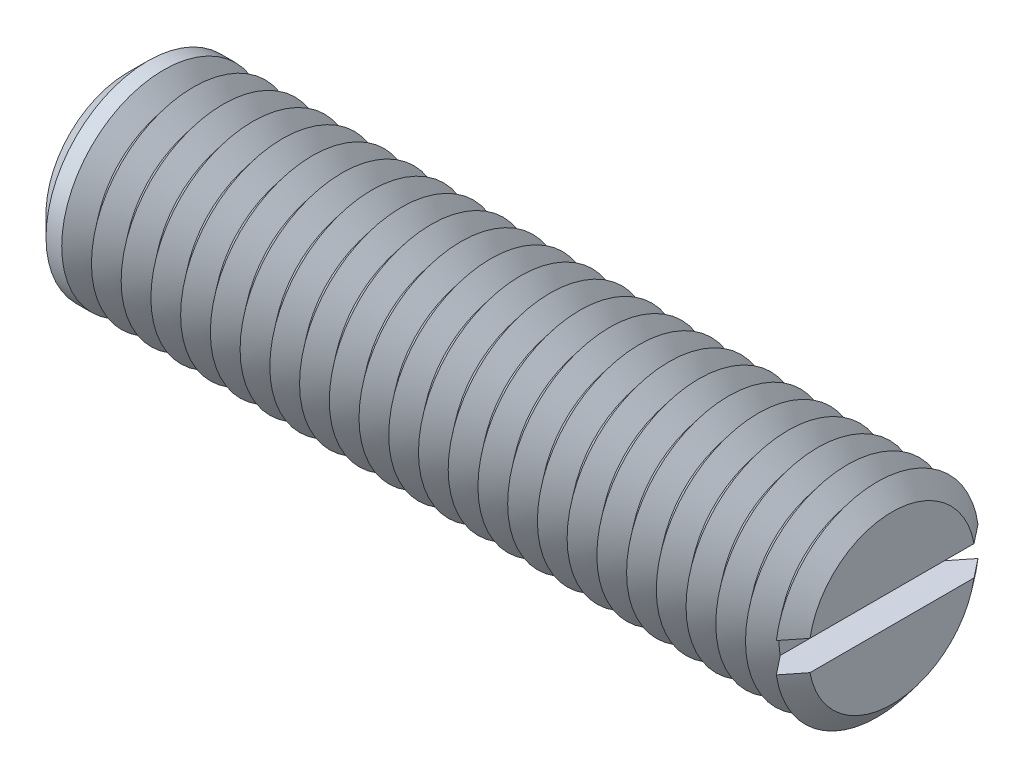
ISO-10303-21;
HEADER;
FILE_DESCRIPTION(('STEP AP214'),'2;1');
FILE_NAME('part.step','',(''),(''),'','','');
FILE_SCHEMA(('AUTOMOTIVE_DESIGN { 1 0 10303 214 1 1 1 1 }'));
ENDSEC;
DATA;
#1=APPLICATION_CONTEXT('core data for automotive mechanical design processes');
#2=APPLICATION_PROTOCOL_DEFINITION('international standard','automotive_design',2000,#1);
#3=PRODUCT_CONTEXT('',#1,'mechanical');
#4=PRODUCT('Part','Part','',(#3));
#5=PRODUCT_RELATED_PRODUCT_CATEGORY('part','',(#4));
#6=PRODUCT_DEFINITION_FORMATION('','',#4);
#7=PRODUCT_DEFINITION_CONTEXT('part definition',#1,'design');
#8=PRODUCT_DEFINITION('design','',#6,#7);
#9=PRODUCT_DEFINITION_SHAPE('','',#8);
#10=(LENGTH_UNIT() NAMED_UNIT(*) SI_UNIT(.MILLI.,.METRE.));
#11=(NAMED_UNIT(*) PLANE_ANGLE_UNIT() SI_UNIT($,.RADIAN.));
#12=(NAMED_UNIT(*) SI_UNIT($,.STERADIAN.) SOLID_ANGLE_UNIT());
#13=UNCERTAINTY_MEASURE_WITH_UNIT(LENGTH_MEASURE(1.E-05),#10,'distance_accuracy_value','');
#14=(GEOMETRIC_REPRESENTATION_CONTEXT(3) GLOBAL_UNCERTAINTY_ASSIGNED_CONTEXT((#13)) GLOBAL_UNIT_ASSIGNED_CONTEXT((#10,
#11,#12)) REPRESENTATION_CONTEXT('',''));
#15=CARTESIAN_POINT('',(0.,0.,0.));
#16=DIRECTION('',(0.,0.,1.));
#17=DIRECTION('',(1.,0.,0.));
#18=AXIS2_PLACEMENT_3D('',#15,#16,#17);
#19=CARTESIAN_POINT('',(21.625,0.,0.));
#20=DIRECTION('',(1.,0.,0.));
#21=DIRECTION('',(0.,0.,-1.));
#22=AXIS2_PLACEMENT_3D('',#19,#20,#21);
#23=CONICAL_SURFACE('',#22,6.,0.895664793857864);
#24=CARTESIAN_POINT('',(21.625,0.,0.));
#25=DIRECTION('',(-1.,0.,0.));
#26=DIRECTION('',(0.,0.,1.));
#27=AXIS2_PLACEMENT_3D('',#24,#25,#26);
#28=CIRCLE('',#27,6.);
#29=CARTESIAN_POINT('',(21.625,-0.875,-5.93585503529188));
#30=VERTEX_POINT('',#29);
#31=CARTESIAN_POINT('',(21.625,-0.875,5.93585503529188));
#32=VERTEX_POINT('',#31);
#33=EDGE_CURVE('E117',#30,#32,#28,.T.);
#34=ORIENTED_EDGE('',*,*,#33,.T.);
#35=CARTESIAN_POINT('',(27.315666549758,-0.875,-13.0784023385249));
#36=CARTESIAN_POINT('',(26.9425848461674,-0.875,-12.6113718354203));
#37=CARTESIAN_POINT('',(26.5695485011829,-0.875,-12.1443050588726));
#38=CARTESIAN_POINT('',(25.8235952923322,-0.875,-11.2100035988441));
#39=CARTESIAN_POINT('',(25.4506784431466,-0.875,-10.7427689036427));
#40=CARTESIAN_POINT('',(24.7043910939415,-0.875,-9.80728158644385));
#41=CARTESIAN_POINT('',(24.3310209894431,-0.875,-9.33902864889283));
#42=CARTESIAN_POINT('',(23.584654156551,-0.875,-8.40229688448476));
#43=CARTESIAN_POINT('',(23.2116573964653,-0.875,-7.93381808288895));
#44=CARTESIAN_POINT('',(22.6431910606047,-0.875,-7.21894008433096));
#45=CARTESIAN_POINT('',(22.4475150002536,-0.875,-6.9727050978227));
#46=CARTESIAN_POINT('',(22.0563780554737,-0.875,-6.48006014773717));
#47=CARTESIAN_POINT('',(21.8609171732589,-0.875,-6.23365018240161));
#48=CARTESIAN_POINT('',(21.4702437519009,-0.875,-5.74051596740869));
#49=CARTESIAN_POINT('',(21.2750313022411,-0.875,-5.4937916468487));
#50=CARTESIAN_POINT('',(20.8850627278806,-0.875,-4.99999724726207));
#51=CARTESIAN_POINT('',(20.6903065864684,-0.875,-4.75292718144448));
#52=CARTESIAN_POINT('',(20.3017454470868,-0.875,-4.25854698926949));
#53=CARTESIAN_POINT('',(20.1079395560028,-0.875,-4.01123756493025));
#54=CARTESIAN_POINT('',(19.7214614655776,-0.875,-3.51567639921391));
#55=CARTESIAN_POINT('',(19.5287894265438,-0.875,-3.26742453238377));
#56=CARTESIAN_POINT('',(19.2415141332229,-0.875,-2.89382702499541));
#57=CARTESIAN_POINT('',(19.1460716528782,-0.875,-2.76912721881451));
#58=CARTESIAN_POINT('',(18.9560120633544,-0.875,-2.51908954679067));
#59=CARTESIAN_POINT('',(18.8613949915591,-0.875,-2.39375165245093));
#60=CARTESIAN_POINT('',(18.6734585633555,-0.875,-2.14215479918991));
#61=CARTESIAN_POINT('',(18.5801388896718,-0.875,-2.01589607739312));
#62=CARTESIAN_POINT('',(18.3955738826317,-0.875,-1.7618740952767));
#63=CARTESIAN_POINT('',(18.3043283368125,-0.875,-1.63411099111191));
#64=CARTESIAN_POINT('',(18.1947335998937,-0.875,-1.47575777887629));
#65=CARTESIAN_POINT('',(18.1745750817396,-0.875,-1.44642115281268));
#66=CARTESIAN_POINT('',(18.1344943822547,-0.875,-1.38758643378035));
#67=CARTESIAN_POINT('',(18.1145722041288,-0.875,-1.35808833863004));
#68=CARTESIAN_POINT('',(18.0552118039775,-0.875,-1.26931303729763));
#69=CARTESIAN_POINT('',(18.0161833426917,-0.875,-1.20976002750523));
#70=CARTESIAN_POINT('',(17.939598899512,-0.875,-1.08955604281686));
#71=CARTESIAN_POINT('',(17.9020457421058,-0.875,-1.02890325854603));
#72=CARTESIAN_POINT('',(17.8292052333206,-0.875,-0.906252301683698));
#73=CARTESIAN_POINT('',(17.7939174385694,-0.875,-0.84425439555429));
#74=CARTESIAN_POINT('',(17.7387563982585,-0.875,-0.740802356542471));
#75=CARTESIAN_POINT('',(17.717869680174,-0.875,-0.699896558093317));
#76=CARTESIAN_POINT('',(17.6780353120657,-0.875,-0.617162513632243));
#77=CARTESIAN_POINT('',(17.6590880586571,-0.875,-0.575334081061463));
#78=CARTESIAN_POINT('',(17.606232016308,-0.875,-0.448426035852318));
#79=CARTESIAN_POINT('',(17.5761075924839,-0.875,-0.361569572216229));
#80=CARTESIAN_POINT('',(17.5472166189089,-0.875,-0.240214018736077));
#81=CARTESIAN_POINT('',(17.5406925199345,-0.875,-0.207555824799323));
#82=CARTESIAN_POINT('',(17.5303887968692,-0.875,-0.141816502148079));
#83=CARTESIAN_POINT('',(17.5266076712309,-0.875,-0.108735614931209));
#84=CARTESIAN_POINT('',(17.5220436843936,-0.875,-0.042454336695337));
#85=CARTESIAN_POINT('',(17.5212526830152,-0.875,-0.0092545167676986));
#86=CARTESIAN_POINT('',(17.522702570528,-0.875,0.0570804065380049));
#87=CARTESIAN_POINT('',(17.5249438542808,-0.875,0.0902155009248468));
#88=CARTESIAN_POINT('',(17.5331880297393,-0.875,0.164063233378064));
#89=CARTESIAN_POINT('',(17.5399634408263,-0.875,0.204689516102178));
#90=CARTESIAN_POINT('',(17.5573167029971,-0.875,0.285126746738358));
#91=CARTESIAN_POINT('',(17.5678973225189,-0.875,0.324937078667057));
#92=CARTESIAN_POINT('',(17.5921930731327,-0.875,0.403898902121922));
#93=CARTESIAN_POINT('',(17.6059311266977,-0.875,0.443043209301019));
#94=CARTESIAN_POINT('',(17.6357974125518,-0.875,0.520385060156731));
#95=CARTESIAN_POINT('',(17.651925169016,-0.875,0.558582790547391));
#96=CARTESIAN_POINT('',(17.7021457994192,-0.875,0.669991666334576));
#97=CARTESIAN_POINT('',(17.7387706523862,-0.875,0.742052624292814));
#98=CARTESIAN_POINT('',(17.816117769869,-0.875,0.883956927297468));
#99=CARTESIAN_POINT('',(17.8568440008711,-0.875,0.953798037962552));
#100=CARTESIAN_POINT('',(17.9409804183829,-0.875,1.09208391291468));
#101=CARTESIAN_POINT('',(17.9843973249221,-0.875,1.16052456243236));
#102=CARTESIAN_POINT('',(18.0729384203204,-0.875,1.29629435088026));
#103=CARTESIAN_POINT('',(18.118062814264,-0.875,1.36362335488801));
#104=CARTESIAN_POINT('',(18.2096565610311,-0.875,1.49772496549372));
#105=CARTESIAN_POINT('',(18.2561302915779,-0.875,1.56449457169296));
#106=CARTESIAN_POINT('',(18.3499281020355,-0.875,1.69744165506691));
#107=CARTESIAN_POINT('',(18.3972522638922,-0.875,1.76361907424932));
#108=CARTESIAN_POINT('',(18.4924358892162,-0.875,1.89539956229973));
#109=CARTESIAN_POINT('',(18.5402941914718,-0.875,1.96100347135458));
#110=CARTESIAN_POINT('',(18.636481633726,-0.875,2.09186112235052));
#111=CARTESIAN_POINT('',(18.6848107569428,-0.875,2.15711487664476));
#112=CARTESIAN_POINT('',(18.8290907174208,-0.875,2.35079303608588));
#113=CARTESIAN_POINT('',(18.925565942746,-0.875,2.47882657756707));
#114=CARTESIAN_POINT('',(19.1194152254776,-0.875,2.73421191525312));
#115=CARTESIAN_POINT('',(19.216789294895,-0.875,2.86156370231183));
#116=CARTESIAN_POINT('',(19.5098183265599,-0.875,3.24294102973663));
#117=CARTESIAN_POINT('',(19.7063709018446,-0.875,3.49627631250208));
#118=CARTESIAN_POINT('',(20.1008478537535,-0.875,4.00219025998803));
#119=CARTESIAN_POINT('',(20.2987731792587,-0.875,4.25476818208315));
#120=CARTESIAN_POINT('',(20.6953507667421,-0.875,4.75934213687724));
#121=CARTESIAN_POINT('',(20.894003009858,-0.875,5.01133818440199));
#122=CARTESIAN_POINT('',(21.2908446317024,-0.875,5.51379367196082));
#123=CARTESIAN_POINT('',(21.4890318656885,-0.875,5.76425480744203));
#124=CARTESIAN_POINT('',(21.8857195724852,-0.875,6.26493161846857));
#125=CARTESIAN_POINT('',(22.0842200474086,-0.875,6.51514729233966));
#126=CARTESIAN_POINT('',(22.6799499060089,-0.875,7.2654171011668));
#127=CARTESIAN_POINT('',(23.0775028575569,-0.875,7.76521426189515));
#128=CARTESIAN_POINT('',(23.794311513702,-0.875,8.66550309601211));
#129=CARTESIAN_POINT('',(24.1134832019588,-0.875,9.06606170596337));
#130=CARTESIAN_POINT('',(24.7520581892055,-0.875,9.86704239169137));
#131=CARTESIAN_POINT('',(25.0714615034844,-0.875,10.2674644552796));
#132=CARTESIAN_POINT('',(25.7116162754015,-0.875,11.0697025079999));
#133=CARTESIAN_POINT('',(26.0323682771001,-0.875,11.4715180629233));
#134=CARTESIAN_POINT('',(26.6739570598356,-0.875,12.2750327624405));
#135=CARTESIAN_POINT('',(26.9947938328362,-0.875,12.6767319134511));
#136=CARTESIAN_POINT('',(27.315666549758,-0.875,13.0784023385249));
#137=B_SPLINE_CURVE_WITH_KNOTS('',3,(#35,#36,#37,#38,#39,#40,#41,#42,#43,#44,#45,#46,#47,#48,
#49,#50,#51,#52,#53,#54,#55,#56,#57,#58,#59,#60,#61,#62,#63,#64,#65,#66,#67,#68,#69,#70,#71,#72,
#73,#74,#75,#76,#77,#78,#79,#80,#81,#82,#83,#84,#85,#86,#87,#88,#89,#90,#91,#92,#93,#94,#95,#96,
#97,#98,#99,#100,#101,#102,#103,#104,#105,#106,#107,#108,#109,#110,#111,#112,#113,#114,#115,
#116,#117,#118,#119,#120,#121,#122,#123,#124,#125,#126,#127,#128,#129,#130,#131,#132,#133,#134,
#135,#136),.UNSPECIFIED.,.F.,.F.,(4,2,2,2,2,2,2,2,2,2,2,2,2,2,2,2,2,2,2,2,2,2,2,2,2,2,2,2,2,2,2,
2,2,2,2,2,2,2,2,2,2,2,2,2,2,2,2,2,2,2,4),(0.,1.7932560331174,3.58668207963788,5.38334403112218,
7.17983772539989,8.12338791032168,9.06694771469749,10.0107838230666,10.9545848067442,
11.8971886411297,12.8399226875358,13.3110192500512,13.7821370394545,14.2531375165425,
14.72408952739,14.8308734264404,14.9376587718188,15.1512485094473,15.3652290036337,
15.5791674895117,15.7169026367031,15.8546658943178,16.1289739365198,16.2287885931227,
16.3285485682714,16.4280367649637,16.5275379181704,16.6508760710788,16.7743041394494,
16.8986582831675,17.0229876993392,17.2652294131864,17.5077076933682,17.7508180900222,
17.9939577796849,18.2380016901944,18.4820692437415,18.7256822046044,18.9692865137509,
19.4502162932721,19.9311525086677,20.8930708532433,21.855738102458,22.8183805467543,
23.7765455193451,24.7347169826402,26.6505999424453,28.1871088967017,29.7237307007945,
31.2661438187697,32.8084427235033),.UNSPECIFIED.);
#138=CARTESIAN_POINT('',(20.75,-0.875,4.82848363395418));
#139=VERTEX_POINT('',#138);
#140=EDGE_CURVE('E109',#139,#32,#137,.T.);
#141=ORIENTED_EDGE('',*,*,#140,.F.);
#142=CARTESIAN_POINT('',(20.75,0.,0.));
#143=DIRECTION('',(-1.,0.,0.));
#144=DIRECTION('',(0.,0.,1.));
#145=AXIS2_PLACEMENT_3D('',#142,#143,#144);
#146=CIRCLE('',#145,4.90712535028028);
#147=CARTESIAN_POINT('',(20.75,-0.875,-4.82848363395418));
#148=VERTEX_POINT('',#147);
#149=EDGE_CURVE('E416',#148,#139,#146,.T.);
#150=ORIENTED_EDGE('',*,*,#149,.F.);
#151=EDGE_CURVE('E58',#30,#148,#137,.T.);
#152=ORIENTED_EDGE('',*,*,#151,.F.);
#153=EDGE_LOOP('',(#34,#141,#150,#152));
#154=FACE_BOUND('',#153,.T.);
#155=ADVANCED_FACE('F37',(#154),#23,.T.);
#156=CARTESIAN_POINT('',(21.625,0.875,5.93585503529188));
#157=VERTEX_POINT('',#156);
#158=CARTESIAN_POINT('',(21.625,0.875,-5.93585503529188));
#159=VERTEX_POINT('',#158);
#160=EDGE_CURVE('E100',#157,#159,#28,.T.);
#161=ORIENTED_EDGE('',*,*,#160,.T.);
#162=CARTESIAN_POINT('',(27.315666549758,0.875,13.0784023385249));
#163=CARTESIAN_POINT('',(26.9425848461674,0.875,12.6113718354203));
#164=CARTESIAN_POINT('',(26.5695485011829,0.875,12.1443050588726));
#165=CARTESIAN_POINT('',(25.8235952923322,0.875,11.2100035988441));
#166=CARTESIAN_POINT('',(25.4506784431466,0.875,10.7427689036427));
#167=CARTESIAN_POINT('',(24.7043910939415,0.875,9.80728158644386));
#168=CARTESIAN_POINT('',(24.3310209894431,0.875,9.33902864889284));
#169=CARTESIAN_POINT('',(23.584654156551,0.875,8.40229688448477));
#170=CARTESIAN_POINT('',(23.2116573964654,0.875,7.93381808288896));
#171=CARTESIAN_POINT('',(22.6431910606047,0.875,7.21894008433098));
#172=CARTESIAN_POINT('',(22.4475150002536,0.875,6.97270509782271));
#173=CARTESIAN_POINT('',(22.0563780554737,0.875,6.48006014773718));
#174=CARTESIAN_POINT('',(21.8609171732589,0.875,6.23365018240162));
#175=CARTESIAN_POINT('',(21.4702437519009,0.875,5.7405159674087));
#176=CARTESIAN_POINT('',(21.2750313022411,0.875,5.49379164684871));
#177=CARTESIAN_POINT('',(20.8850627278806,0.875,4.99999724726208));
#178=CARTESIAN_POINT('',(20.6903065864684,0.875,4.75292718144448));
#179=CARTESIAN_POINT('',(20.3017454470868,0.875,4.2585469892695));
#180=CARTESIAN_POINT('',(20.1079395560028,0.875,4.01123756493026));
#181=CARTESIAN_POINT('',(19.7214614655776,0.875,3.51567639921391));
#182=CARTESIAN_POINT('',(19.5287894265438,0.875,3.26742453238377));
#183=CARTESIAN_POINT('',(19.2415141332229,0.875,2.89382702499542));
#184=CARTESIAN_POINT('',(19.1460716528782,0.875,2.76912721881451));
#185=CARTESIAN_POINT('',(18.9560120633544,0.875,2.51908954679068));
#186=CARTESIAN_POINT('',(18.8613949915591,0.875,2.39375165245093));
#187=CARTESIAN_POINT('',(18.6734585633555,0.875,2.14215479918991));
#188=CARTESIAN_POINT('',(18.5801388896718,0.875,2.01589607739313));
#189=CARTESIAN_POINT('',(18.3955738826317,0.875,1.7618740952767));
#190=CARTESIAN_POINT('',(18.3043283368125,0.875,1.63411099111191));
#191=CARTESIAN_POINT('',(18.1947335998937,0.875,1.47575777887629));
#192=CARTESIAN_POINT('',(18.1745750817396,0.875,1.44642115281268));
#193=CARTESIAN_POINT('',(18.1344943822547,0.875,1.38758643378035));
#194=CARTESIAN_POINT('',(18.1145722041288,0.875,1.35808833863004));
#195=CARTESIAN_POINT('',(18.0552118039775,0.875,1.26931303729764));
#196=CARTESIAN_POINT('',(18.0161833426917,0.875,1.20976002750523));
#197=CARTESIAN_POINT('',(17.939598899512,0.875,1.08955604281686));
#198=CARTESIAN_POINT('',(17.9020457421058,0.875,1.02890325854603));
#199=CARTESIAN_POINT('',(17.8292052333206,0.875,0.906252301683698));
#200=CARTESIAN_POINT('',(17.7939174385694,0.875,0.844254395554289));
#201=CARTESIAN_POINT('',(17.7387563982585,0.875,0.740802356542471));
#202=CARTESIAN_POINT('',(17.717869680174,0.875,0.699896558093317));
#203=CARTESIAN_POINT('',(17.6780353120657,0.875,0.617162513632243));
#204=CARTESIAN_POINT('',(17.6590880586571,0.875,0.575334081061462));
#205=CARTESIAN_POINT('',(17.606232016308,0.875,0.448426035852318));
#206=CARTESIAN_POINT('',(17.5761075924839,0.875,0.361569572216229));
#207=CARTESIAN_POINT('',(17.5472166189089,0.875,0.240214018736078));
#208=CARTESIAN_POINT('',(17.5406925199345,0.875,0.207555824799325));
#209=CARTESIAN_POINT('',(17.5303887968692,0.875,0.141816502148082));
#210=CARTESIAN_POINT('',(17.5266076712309,0.875,0.108735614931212));
#211=CARTESIAN_POINT('',(17.5220436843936,0.875,0.0424543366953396));
#212=CARTESIAN_POINT('',(17.5212526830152,0.875,0.00925451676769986));
#213=CARTESIAN_POINT('',(17.522702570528,0.875,-0.0570804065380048));
#214=CARTESIAN_POINT('',(17.5249438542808,0.875,-0.0902155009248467));
#215=CARTESIAN_POINT('',(17.5331880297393,0.875,-0.164063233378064));
#216=CARTESIAN_POINT('',(17.5399634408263,0.875,-0.204689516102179));
#217=CARTESIAN_POINT('',(17.5573167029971,0.875,-0.28512674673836));
#218=CARTESIAN_POINT('',(17.5678973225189,0.875,-0.324937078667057));
#219=CARTESIAN_POINT('',(17.5921930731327,0.875,-0.403898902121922));
#220=CARTESIAN_POINT('',(17.6059311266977,0.875,-0.44304320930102));
#221=CARTESIAN_POINT('',(17.6357974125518,0.875,-0.520385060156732));
#222=CARTESIAN_POINT('',(17.651925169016,0.875,-0.558582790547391));
#223=CARTESIAN_POINT('',(17.7021457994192,0.875,-0.669991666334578));
#224=CARTESIAN_POINT('',(17.7387706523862,0.875,-0.742052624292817));
#225=CARTESIAN_POINT('',(17.816117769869,0.875,-0.883956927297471));
#226=CARTESIAN_POINT('',(17.8568440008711,0.875,-0.953798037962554));
#227=CARTESIAN_POINT('',(17.9409804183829,0.875,-1.09208391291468));
#228=CARTESIAN_POINT('',(17.9843973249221,0.875,-1.16052456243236));
#229=CARTESIAN_POINT('',(18.0729384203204,0.875,-1.29629435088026));
#230=CARTESIAN_POINT('',(18.118062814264,0.875,-1.36362335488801));
#231=CARTESIAN_POINT('',(18.2096565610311,0.875,-1.49772496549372));
#232=CARTESIAN_POINT('',(18.2561302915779,0.875,-1.56449457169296));
#233=CARTESIAN_POINT('',(18.3499281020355,0.875,-1.69744165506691));
#234=CARTESIAN_POINT('',(18.3972522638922,0.875,-1.76361907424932));
#235=CARTESIAN_POINT('',(18.4924358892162,0.875,-1.89539956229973));
#236=CARTESIAN_POINT('',(18.5402941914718,0.875,-1.96100347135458));
#237=CARTESIAN_POINT('',(18.636481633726,0.875,-2.09186112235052));
#238=CARTESIAN_POINT('',(18.6848107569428,0.875,-2.15711487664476));
#239=CARTESIAN_POINT('',(18.8290907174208,0.875,-2.35079303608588));
#240=CARTESIAN_POINT('',(18.925565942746,0.875,-2.47882657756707));
#241=CARTESIAN_POINT('',(19.1194152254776,0.875,-2.73421191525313));
#242=CARTESIAN_POINT('',(19.216789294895,0.875,-2.86156370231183));
#243=CARTESIAN_POINT('',(19.5098183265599,0.875,-3.24294102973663));
#244=CARTESIAN_POINT('',(19.7063709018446,0.875,-3.49627631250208));
#245=CARTESIAN_POINT('',(20.1008478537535,0.875,-4.00219025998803));
#246=CARTESIAN_POINT('',(20.2987731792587,0.875,-4.25476818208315));
#247=CARTESIAN_POINT('',(20.6953507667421,0.875,-4.75934213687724));
#248=CARTESIAN_POINT('',(20.894003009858,0.875,-5.01133818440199));
#249=CARTESIAN_POINT('',(21.2908446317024,0.875,-5.51379367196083));
#250=CARTESIAN_POINT('',(21.4890318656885,0.875,-5.76425480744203));
#251=CARTESIAN_POINT('',(21.8857195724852,0.875,-6.26493161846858));
#252=CARTESIAN_POINT('',(22.0842200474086,0.875,-6.51514729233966));
#253=CARTESIAN_POINT('',(22.6799499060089,0.875,-7.26541710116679));
#254=CARTESIAN_POINT('',(23.0775028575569,0.875,-7.76521426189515));
#255=CARTESIAN_POINT('',(23.794311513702,0.875,-8.6655030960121));
#256=CARTESIAN_POINT('',(24.1134832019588,0.875,-9.06606170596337));
#257=CARTESIAN_POINT('',(24.7520581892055,0.875,-9.86704239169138));
#258=CARTESIAN_POINT('',(25.0714615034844,0.875,-10.2674644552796));
#259=CARTESIAN_POINT('',(25.7116162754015,0.875,-11.0697025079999));
#260=CARTESIAN_POINT('',(26.0323682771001,0.875,-11.4715180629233));
#261=CARTESIAN_POINT('',(26.6739570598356,0.875,-12.2750327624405));
#262=CARTESIAN_POINT('',(26.9947938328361,0.875,-12.6767319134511));
#263=CARTESIAN_POINT('',(27.315666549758,0.875,-13.0784023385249));
#264=B_SPLINE_CURVE_WITH_KNOTS('',3,(#162,#163,#164,#165,#166,#167,#168,#169,#170,#171,#172,
#173,#174,#175,#176,#177,#178,#179,#180,#181,#182,#183,#184,#185,#186,#187,#188,#189,#190,#191,
#192,#193,#194,#195,#196,#197,#198,#199,#200,#201,#202,#203,#204,#205,#206,#207,#208,#209,#210,
#211,#212,#213,#214,#215,#216,#217,#218,#219,#220,#221,#222,#223,#224,#225,#226,#227,#228,#229,
#230,#231,#232,#233,#234,#235,#236,#237,#238,#239,#240,#241,#242,#243,#244,#245,#246,#247,#248,
#249,#250,#251,#252,#253,#254,#255,#256,#257,#258,#259,#260,#261,#262,#263),.UNSPECIFIED.,.F.,
.F.,(4,2,2,2,2,2,2,2,2,2,2,2,2,2,2,2,2,2,2,2,2,2,2,2,2,2,2,2,2,2,2,2,2,2,2,2,2,2,2,2,2,2,2,2,2,
2,2,2,2,2,4),(0.,1.79325603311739,3.58668207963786,5.38334403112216,7.17983772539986,
8.12338791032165,9.06694771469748,10.0107838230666,10.9545848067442,11.8971886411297,
12.8399226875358,13.3110192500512,13.7821370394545,14.2531375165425,14.72408952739,
14.8308734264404,14.9376587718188,15.1512485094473,15.3652290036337,15.5791674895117,
15.7169026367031,15.8546658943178,16.1289739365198,16.2287885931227,16.3285485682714,
16.4280367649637,16.5275379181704,16.6508760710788,16.7743041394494,16.8986582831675,
17.0229876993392,17.2652294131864,17.5077076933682,17.7508180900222,17.9939577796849,
18.2380016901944,18.4820692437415,18.7256822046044,18.9692865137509,19.4502162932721,
19.9311525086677,20.8930708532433,21.855738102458,22.8183805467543,23.7765455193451,
24.7347169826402,26.6505999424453,28.1871088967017,29.7237307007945,31.2661438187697,
32.8084427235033),.UNSPECIFIED.);
#265=CARTESIAN_POINT('',(20.75,0.875,-4.82848363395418));
#266=VERTEX_POINT('',#265);
#267=EDGE_CURVE('E110',#266,#159,#264,.T.);
#268=ORIENTED_EDGE('',*,*,#267,.F.);
#269=CARTESIAN_POINT('',(20.75,0.875,4.82848363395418));
#270=VERTEX_POINT('',#269);
#271=EDGE_CURVE('E103',#270,#266,#146,.T.);
#272=ORIENTED_EDGE('',*,*,#271,.F.);
#273=EDGE_CURVE('E97',#157,#270,#264,.T.);
#274=ORIENTED_EDGE('',*,*,#273,.F.);
#275=EDGE_LOOP('',(#161,#268,#272,#274));
#276=FACE_BOUND('',#275,.T.);
#277=ADVANCED_FACE('F99',(#276),#23,.T.);
#278=CARTESIAN_POINT('',(20.75,0.,0.));
#279=DIRECTION('',(-1.,0.,0.));
#280=DIRECTION('',(0.,0.,1.));
#281=AXIS2_PLACEMENT_3D('',#278,#279,#280);
#282=CONICAL_SURFACE('',#281,4.90712535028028,0.895664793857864);
#283=CARTESIAN_POINT('',(19.875,0.,0.));
#284=DIRECTION('',(-1.,0.,0.));
#285=DIRECTION('',(0.,0.,1.));
#286=AXIS2_PLACEMENT_3D('',#283,#284,#285);
#287=CIRCLE('',#286,6.);
#288=CARTESIAN_POINT('',(19.875,0.,6.));
#289=VERTEX_POINT('',#288);
#290=EDGE_CURVE('E403',#289,#289,#287,.T.);
#291=ORIENTED_EDGE('',*,*,#290,.F.);
#292=EDGE_LOOP('',(#291));
#293=FACE_BOUND('',#292,.T.);
#294=ORIENTED_EDGE('',*,*,#271,.T.);
#295=EDGE_CURVE('E411',#266,#148,#146,.T.);
#296=ORIENTED_EDGE('',*,*,#295,.T.);
#297=ORIENTED_EDGE('',*,*,#149,.T.);
#298=EDGE_CURVE('E410',#139,#270,#146,.T.);
#299=ORIENTED_EDGE('',*,*,#298,.T.);
#300=EDGE_LOOP('',(#294,#296,#297,#299));
#301=FACE_BOUND('',#300,.T.);
#302=ADVANCED_FACE('F166',(#293,#301),#282,.T.);
#303=CARTESIAN_POINT('',(22.5,0.,0.));
#304=DIRECTION('',(1.,0.,0.));
#305=DIRECTION('',(0.,0.,-1.));
#306=AXIS2_PLACEMENT_3D('',#303,#304,#305);
#307=PLANE('',#306);
#308=CARTESIAN_POINT('',(22.5,0.,0.));
#309=DIRECTION('',(-1.,0.,0.));
#310=DIRECTION('',(0.,0.,1.));
#311=AXIS2_PLACEMENT_3D('',#308,#309,#310);
#312=CIRCLE('',#311,4.90712535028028);
#313=CARTESIAN_POINT('',(22.5,0.875,4.82848363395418));
#314=VERTEX_POINT('',#313);
#315=CARTESIAN_POINT('',(22.5,0.875,-4.82848363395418));
#316=VERTEX_POINT('',#315);
#317=EDGE_CURVE('E158',#314,#316,#312,.T.);
#318=ORIENTED_EDGE('',*,*,#317,.F.);
#319=DIRECTION('',(0.,0.,1.));
#320=VECTOR('',#319,1.);
#321=CARTESIAN_POINT('',(22.5,0.875,0.));
#322=LINE('',#321,#320);
#323=EDGE_CURVE('E122',#316,#314,#322,.T.);
#324=ORIENTED_EDGE('',*,*,#323,.F.);
#325=EDGE_LOOP('',(#318,#324));
#326=FACE_BOUND('',#325,.T.);
#327=ADVANCED_FACE('F170',(#326),#307,.T.);
#328=CARTESIAN_POINT('',(22.5,-0.875,-4.82848363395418));
#329=VERTEX_POINT('',#328);
#330=CARTESIAN_POINT('',(22.5,-0.875,4.82848363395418));
#331=VERTEX_POINT('',#330);
#332=EDGE_CURVE('E66',#329,#331,#312,.T.);
#333=ORIENTED_EDGE('',*,*,#332,.F.);
#334=DIRECTION('',(0.,0.,-1.));
#335=VECTOR('',#334,1.);
#336=CARTESIAN_POINT('',(22.5,-0.875,0.));
#337=LINE('',#336,#335);
#338=EDGE_CURVE('E134',#331,#329,#337,.T.);
#339=ORIENTED_EDGE('',*,*,#338,.F.);
#340=EDGE_LOOP('',(#333,#339));
#341=FACE_BOUND('',#340,.T.);
#342=ADVANCED_FACE('F199',(#341),#307,.T.);
#343=CARTESIAN_POINT('',(22.5,0.,0.));
#344=DIRECTION('',(-1.,0.,0.));
#345=DIRECTION('',(0.,0.,1.));
#346=AXIS2_PLACEMENT_3D('',#343,#344,#345);
#347=CONICAL_SURFACE('',#346,4.90712535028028,0.895664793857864);
#348=ORIENTED_EDGE('',*,*,#160,.F.);
#349=CARTESIAN_POINT('',(15.934333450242,0.875,-13.0784023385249));
#350=CARTESIAN_POINT('',(16.3074151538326,0.875,-12.6113718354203));
#351=CARTESIAN_POINT('',(16.6804514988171,0.875,-12.1443050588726));
#352=CARTESIAN_POINT('',(17.4264047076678,0.875,-11.2100035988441));
#353=CARTESIAN_POINT('',(17.7993215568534,0.875,-10.7427689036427));
#354=CARTESIAN_POINT('',(18.5456089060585,0.875,-9.80728158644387));
#355=CARTESIAN_POINT('',(18.9189790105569,0.875,-9.33902864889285));
#356=CARTESIAN_POINT('',(19.665345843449,0.875,-8.40229688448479));
#357=CARTESIAN_POINT('',(20.0383426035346,0.875,-7.93381808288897));
#358=CARTESIAN_POINT('',(20.6068089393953,0.875,-7.21894008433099));
#359=CARTESIAN_POINT('',(20.8024849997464,0.875,-6.97270509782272));
#360=CARTESIAN_POINT('',(21.1936219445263,0.875,-6.48006014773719));
#361=CARTESIAN_POINT('',(21.389082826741,0.875,-6.23365018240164));
#362=CARTESIAN_POINT('',(21.7797562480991,0.875,-5.74051596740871));
#363=CARTESIAN_POINT('',(21.9749686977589,0.875,-5.49379164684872));
#364=CARTESIAN_POINT('',(22.3649372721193,0.875,-4.99999724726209));
#365=CARTESIAN_POINT('',(22.5596934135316,0.875,-4.75292718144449));
#366=CARTESIAN_POINT('',(22.9482545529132,0.875,-4.25854698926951));
#367=CARTESIAN_POINT('',(23.1420604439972,0.875,-4.01123756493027));
#368=CARTESIAN_POINT('',(23.5285385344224,0.875,-3.51567639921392));
#369=CARTESIAN_POINT('',(23.7212105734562,0.875,-3.26742453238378));
#370=CARTESIAN_POINT('',(24.0084858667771,0.875,-2.89382702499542));
#371=CARTESIAN_POINT('',(24.1039283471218,0.875,-2.76912721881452));
#372=CARTESIAN_POINT('',(24.2939879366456,0.875,-2.51908954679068));
#373=CARTESIAN_POINT('',(24.3886050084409,0.875,-2.39375165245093));
#374=CARTESIAN_POINT('',(24.5765414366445,0.875,-2.14215479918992));
#375=CARTESIAN_POINT('',(24.6698611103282,0.875,-2.01589607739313));
#376=CARTESIAN_POINT('',(24.8544261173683,0.875,-1.76187409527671));
#377=CARTESIAN_POINT('',(24.9456716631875,0.875,-1.63411099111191));
#378=CARTESIAN_POINT('',(25.0552664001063,0.875,-1.47575777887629));
#379=CARTESIAN_POINT('',(25.0754249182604,0.875,-1.44642115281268));
#380=CARTESIAN_POINT('',(25.1155056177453,0.875,-1.38758643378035));
#381=CARTESIAN_POINT('',(25.1354277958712,0.875,-1.35808833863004));
#382=CARTESIAN_POINT('',(25.1947881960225,0.875,-1.26931303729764));
#383=CARTESIAN_POINT('',(25.2338166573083,0.875,-1.20976002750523));
#384=CARTESIAN_POINT('',(25.310401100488,0.875,-1.08955604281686));
#385=CARTESIAN_POINT('',(25.3479542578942,0.875,-1.02890325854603));
#386=CARTESIAN_POINT('',(25.4207947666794,0.875,-0.9062523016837));
#387=CARTESIAN_POINT('',(25.4560825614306,0.875,-0.844254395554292));
#388=CARTESIAN_POINT('',(25.5112436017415,0.875,-0.740802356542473));
#389=CARTESIAN_POINT('',(25.532130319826,0.875,-0.699896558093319));
#390=CARTESIAN_POINT('',(25.5719646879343,0.875,-0.617162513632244));
#391=CARTESIAN_POINT('',(25.5909119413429,0.875,-0.575334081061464));
#392=CARTESIAN_POINT('',(25.643767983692,0.875,-0.448426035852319));
#393=CARTESIAN_POINT('',(25.6738924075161,0.875,-0.361569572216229));
#394=CARTESIAN_POINT('',(25.7027833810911,0.875,-0.240214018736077));
#395=CARTESIAN_POINT('',(25.7093074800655,0.875,-0.207555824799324));
#396=CARTESIAN_POINT('',(25.7196112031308,0.875,-0.141816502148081));
#397=CARTESIAN_POINT('',(25.7233923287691,0.875,-0.108735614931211));
#398=CARTESIAN_POINT('',(25.7279563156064,0.875,-0.0424543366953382));
#399=CARTESIAN_POINT('',(25.7287473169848,0.875,-0.00925451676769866));
#400=CARTESIAN_POINT('',(25.7272974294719,0.875,0.0570804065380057));
#401=CARTESIAN_POINT('',(25.7250561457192,0.875,0.0902155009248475));
#402=CARTESIAN_POINT('',(25.7168119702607,0.875,0.164063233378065));
#403=CARTESIAN_POINT('',(25.7100365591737,0.875,0.20468951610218));
#404=CARTESIAN_POINT('',(25.6926832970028,0.875,0.28512674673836));
#405=CARTESIAN_POINT('',(25.6821026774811,0.875,0.324937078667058));
#406=CARTESIAN_POINT('',(25.6578069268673,0.875,0.403898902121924));
#407=CARTESIAN_POINT('',(25.6440688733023,0.875,0.443043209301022));
#408=CARTESIAN_POINT('',(25.6142025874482,0.875,0.520385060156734));
#409=CARTESIAN_POINT('',(25.598074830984,0.875,0.558582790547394));
#410=CARTESIAN_POINT('',(25.5478542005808,0.875,0.669991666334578));
#411=CARTESIAN_POINT('',(25.5112293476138,0.875,0.742052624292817));
#412=CARTESIAN_POINT('',(25.433882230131,0.875,0.883956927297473));
#413=CARTESIAN_POINT('',(25.3931559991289,0.875,0.953798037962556));
#414=CARTESIAN_POINT('',(25.3090195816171,0.875,1.09208391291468));
#415=CARTESIAN_POINT('',(25.2656026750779,0.875,1.16052456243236));
#416=CARTESIAN_POINT('',(25.1770615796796,0.875,1.29629435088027));
#417=CARTESIAN_POINT('',(25.131937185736,0.875,1.36362335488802));
#418=CARTESIAN_POINT('',(25.0403434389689,0.875,1.49772496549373));
#419=CARTESIAN_POINT('',(24.9938697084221,0.875,1.56449457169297));
#420=CARTESIAN_POINT('',(24.9000718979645,0.875,1.69744165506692));
#421=CARTESIAN_POINT('',(24.8527477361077,0.875,1.76361907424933));
#422=CARTESIAN_POINT('',(24.7575641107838,0.875,1.89539956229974));
#423=CARTESIAN_POINT('',(24.7097058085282,0.875,1.96100347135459));
#424=CARTESIAN_POINT('',(24.6135183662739,0.875,2.09186112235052));
#425=CARTESIAN_POINT('',(24.5651892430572,0.875,2.15711487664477));
#426=CARTESIAN_POINT('',(24.4209092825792,0.875,2.35079303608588));
#427=CARTESIAN_POINT('',(24.3244340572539,0.875,2.47882657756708));
#428=CARTESIAN_POINT('',(24.1305847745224,0.875,2.73421191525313));
#429=CARTESIAN_POINT('',(24.033210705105,0.875,2.86156370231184));
#430=CARTESIAN_POINT('',(23.74018167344,0.875,3.24294102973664));
#431=CARTESIAN_POINT('',(23.5436290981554,0.875,3.4962763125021));
#432=CARTESIAN_POINT('',(23.1491521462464,0.875,4.00219025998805));
#433=CARTESIAN_POINT('',(22.9512268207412,0.875,4.25476818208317));
#434=CARTESIAN_POINT('',(22.5546492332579,0.875,4.75934213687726));
#435=CARTESIAN_POINT('',(22.355996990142,0.875,5.01133818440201));
#436=CARTESIAN_POINT('',(21.9591553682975,0.875,5.51379367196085));
#437=CARTESIAN_POINT('',(21.7609681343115,0.875,5.76425480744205));
#438=CARTESIAN_POINT('',(21.3642804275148,0.875,6.2649316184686));
#439=CARTESIAN_POINT('',(21.1657799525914,0.875,6.51514729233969));
#440=CARTESIAN_POINT('',(20.5700500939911,0.875,7.26541710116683));
#441=CARTESIAN_POINT('',(20.1724971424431,0.875,7.76521426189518));
#442=CARTESIAN_POINT('',(19.455688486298,0.875,8.66550309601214));
#443=CARTESIAN_POINT('',(19.1365167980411,0.875,9.0660617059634));
#444=CARTESIAN_POINT('',(18.4979418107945,0.875,9.8670423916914));
#445=CARTESIAN_POINT('',(18.1785384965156,0.875,10.2674644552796));
#446=CARTESIAN_POINT('',(17.5383837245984,0.875,11.0697025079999));
#447=CARTESIAN_POINT('',(17.2176317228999,0.875,11.4715180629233));
#448=CARTESIAN_POINT('',(16.5760429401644,0.875,12.2750327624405));
#449=CARTESIAN_POINT('',(16.2552061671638,0.875,12.6767319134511));
#450=CARTESIAN_POINT('',(15.934333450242,0.875,13.0784023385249));
#451=B_SPLINE_CURVE_WITH_KNOTS('',3,(#349,#350,#351,#352,#353,#354,#355,#356,#357,#358,#359,
#360,#361,#362,#363,#364,#365,#366,#367,#368,#369,#370,#371,#372,#373,#374,#375,#376,#377,#378,
#379,#380,#381,#382,#383,#384,#385,#386,#387,#388,#389,#390,#391,#392,#393,#394,#395,#396,#397,
#398,#399,#400,#401,#402,#403,#404,#405,#406,#407,#408,#409,#410,#411,#412,#413,#414,#415,#416,
#417,#418,#419,#420,#421,#422,#423,#424,#425,#426,#427,#428,#429,#430,#431,#432,#433,#434,#435,
#436,#437,#438,#439,#440,#441,#442,#443,#444,#445,#446,#447,#448,#449,#450),.UNSPECIFIED.,.F.,
.F.,(4,2,2,2,2,2,2,2,2,2,2,2,2,2,2,2,2,2,2,2,2,2,2,2,2,2,2,2,2,2,2,2,2,2,2,2,2,2,2,2,2,2,2,2,2,
2,2,2,2,2,4),(0.,1.79325603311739,3.58668207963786,5.38334403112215,7.17983772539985,
8.12338791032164,9.06694771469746,10.0107838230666,10.9545848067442,11.8971886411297,
12.8399226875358,13.3110192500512,13.7821370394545,14.2531375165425,14.72408952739,
14.8308734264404,14.9376587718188,15.1512485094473,15.3652290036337,15.5791674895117,
15.7169026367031,15.8546658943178,16.1289739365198,16.2287885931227,16.3285485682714,
16.4280367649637,16.5275379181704,16.6508760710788,16.7743041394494,16.8986582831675,
17.0229876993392,17.2652294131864,17.5077076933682,17.7508180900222,17.9939577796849,
18.2380016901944,18.4820692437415,18.7256822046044,18.9692865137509,19.4502162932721,
19.9311525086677,20.8930708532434,21.855738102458,22.8183805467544,23.7765455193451,
24.7347169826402,26.6505999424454,28.1871088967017,29.7237307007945,31.2661438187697,
32.8084427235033),.UNSPECIFIED.);
#452=EDGE_CURVE('E41',#314,#157,#451,.T.);
#453=ORIENTED_EDGE('',*,*,#452,.F.);
#454=ORIENTED_EDGE('',*,*,#317,.T.);
#455=EDGE_CURVE('E11',#159,#316,#451,.T.);
#456=ORIENTED_EDGE('',*,*,#455,.F.);
#457=EDGE_LOOP('',(#348,#453,#454,#456));
#458=FACE_BOUND('',#457,.T.);
#459=ADVANCED_FACE('F114',(#458),#347,.T.);
#460=CARTESIAN_POINT('',(22.5,0.875,-9.));
#461=DIRECTION('',(0.,1.,0.));
#462=DIRECTION('',(0.,0.,1.));
#463=AXIS2_PLACEMENT_3D('',#460,#461,#462);
#464=PLANE('',#463);
#465=ORIENTED_EDGE('',*,*,#452,.T.);
#466=ORIENTED_EDGE('',*,*,#273,.T.);
#467=DIRECTION('',(0.,0.,1.));
#468=VECTOR('',#467,1.);
#469=CARTESIAN_POINT('',(20.75,0.875,-9.));
#470=LINE('',#469,#468);
#471=EDGE_CURVE('E143',#266,#270,#470,.T.);
#472=ORIENTED_EDGE('',*,*,#471,.F.);
#473=ORIENTED_EDGE('',*,*,#267,.T.);
#474=ORIENTED_EDGE('',*,*,#455,.T.);
#475=ORIENTED_EDGE('',*,*,#323,.T.);
#476=EDGE_LOOP('',(#465,#466,#472,#473,#474,#475));
#477=FACE_BOUND('',#476,.T.);
#478=ADVANCED_FACE('F120',(#477),#464,.F.);
#479=ORIENTED_EDGE('',*,*,#33,.F.);
#480=CARTESIAN_POINT('',(15.934333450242,-0.875,13.0784023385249));
#481=CARTESIAN_POINT('',(16.3074151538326,-0.875,12.6113718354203));
#482=CARTESIAN_POINT('',(16.6804514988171,-0.875,12.1443050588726));
#483=CARTESIAN_POINT('',(17.4264047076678,-0.875,11.2100035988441));
#484=CARTESIAN_POINT('',(17.7993215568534,-0.875,10.7427689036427));
#485=CARTESIAN_POINT('',(18.5456089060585,-0.875,9.80728158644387));
#486=CARTESIAN_POINT('',(18.9189790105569,-0.875,9.33902864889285));
#487=CARTESIAN_POINT('',(19.665345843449,-0.875,8.40229688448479));
#488=CARTESIAN_POINT('',(20.0383426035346,-0.875,7.93381808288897));
#489=CARTESIAN_POINT('',(20.6068089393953,-0.875,7.21894008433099));
#490=CARTESIAN_POINT('',(20.8024849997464,-0.875,6.97270509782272));
#491=CARTESIAN_POINT('',(21.1936219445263,-0.875,6.48006014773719));
#492=CARTESIAN_POINT('',(21.389082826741,-0.875,6.23365018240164));
#493=CARTESIAN_POINT('',(21.7797562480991,-0.875,5.74051596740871));
#494=CARTESIAN_POINT('',(21.9749686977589,-0.875,5.49379164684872));
#495=CARTESIAN_POINT('',(22.3649372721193,-0.875,4.99999724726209));
#496=CARTESIAN_POINT('',(22.5596934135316,-0.875,4.75292718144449));
#497=CARTESIAN_POINT('',(22.9482545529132,-0.875,4.25854698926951));
#498=CARTESIAN_POINT('',(23.1420604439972,-0.875,4.01123756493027));
#499=CARTESIAN_POINT('',(23.5285385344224,-0.875,3.51567639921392));
#500=CARTESIAN_POINT('',(23.7212105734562,-0.875,3.26742453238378));
#501=CARTESIAN_POINT('',(24.0084858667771,-0.875,2.89382702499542));
#502=CARTESIAN_POINT('',(24.1039283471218,-0.875,2.76912721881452));
#503=CARTESIAN_POINT('',(24.2939879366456,-0.875,2.51908954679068));
#504=CARTESIAN_POINT('',(24.3886050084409,-0.875,2.39375165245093));
#505=CARTESIAN_POINT('',(24.5765414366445,-0.875,2.14215479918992));
#506=CARTESIAN_POINT('',(24.6698611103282,-0.875,2.01589607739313));
#507=CARTESIAN_POINT('',(24.8544261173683,-0.875,1.76187409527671));
#508=CARTESIAN_POINT('',(24.9456716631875,-0.875,1.63411099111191));
#509=CARTESIAN_POINT('',(25.0552664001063,-0.875,1.47575777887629));
#510=CARTESIAN_POINT('',(25.0754249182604,-0.875,1.44642115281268));
#511=CARTESIAN_POINT('',(25.1155056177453,-0.875,1.38758643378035));
#512=CARTESIAN_POINT('',(25.1354277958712,-0.875,1.35808833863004));
#513=CARTESIAN_POINT('',(25.1947881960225,-0.875,1.26931303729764));
#514=CARTESIAN_POINT('',(25.2338166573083,-0.875,1.20976002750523));
#515=CARTESIAN_POINT('',(25.310401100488,-0.875,1.08955604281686));
#516=CARTESIAN_POINT('',(25.3479542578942,-0.875,1.02890325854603));
#517=CARTESIAN_POINT('',(25.4207947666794,-0.875,0.9062523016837));
#518=CARTESIAN_POINT('',(25.4560825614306,-0.875,0.844254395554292));
#519=CARTESIAN_POINT('',(25.5112436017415,-0.875,0.740802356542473));
#520=CARTESIAN_POINT('',(25.532130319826,-0.875,0.699896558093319));
#521=CARTESIAN_POINT('',(25.5719646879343,-0.875,0.617162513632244));
#522=CARTESIAN_POINT('',(25.5909119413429,-0.875,0.575334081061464));
#523=CARTESIAN_POINT('',(25.643767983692,-0.875,0.448426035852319));
#524=CARTESIAN_POINT('',(25.6738924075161,-0.875,0.361569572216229));
#525=CARTESIAN_POINT('',(25.7027833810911,-0.875,0.240214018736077));
#526=CARTESIAN_POINT('',(25.7093074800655,-0.875,0.207555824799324));
#527=CARTESIAN_POINT('',(25.7196112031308,-0.875,0.141816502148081));
#528=CARTESIAN_POINT('',(25.7233923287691,-0.875,0.108735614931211));
#529=CARTESIAN_POINT('',(25.7279563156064,-0.875,0.0424543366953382));
#530=CARTESIAN_POINT('',(25.7287473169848,-0.875,0.00925451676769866));
#531=CARTESIAN_POINT('',(25.7272974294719,-0.875,-0.0570804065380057));
#532=CARTESIAN_POINT('',(25.7250561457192,-0.875,-0.0902155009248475));
#533=CARTESIAN_POINT('',(25.7168119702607,-0.875,-0.164063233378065));
#534=CARTESIAN_POINT('',(25.7100365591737,-0.875,-0.20468951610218));
#535=CARTESIAN_POINT('',(25.6926832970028,-0.875,-0.28512674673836));
#536=CARTESIAN_POINT('',(25.6821026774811,-0.875,-0.324937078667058));
#537=CARTESIAN_POINT('',(25.6578069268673,-0.875,-0.403898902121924));
#538=CARTESIAN_POINT('',(25.6440688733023,-0.875,-0.443043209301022));
#539=CARTESIAN_POINT('',(25.6142025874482,-0.875,-0.520385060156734));
#540=CARTESIAN_POINT('',(25.598074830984,-0.875,-0.558582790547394));
#541=CARTESIAN_POINT('',(25.5478542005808,-0.875,-0.669991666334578));
#542=CARTESIAN_POINT('',(25.5112293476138,-0.875,-0.742052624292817));
#543=CARTESIAN_POINT('',(25.433882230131,-0.875,-0.883956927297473));
#544=CARTESIAN_POINT('',(25.3931559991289,-0.875,-0.953798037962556));
#545=CARTESIAN_POINT('',(25.3090195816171,-0.875,-1.09208391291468));
#546=CARTESIAN_POINT('',(25.2656026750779,-0.875,-1.16052456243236));
#547=CARTESIAN_POINT('',(25.1770615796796,-0.875,-1.29629435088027));
#548=CARTESIAN_POINT('',(25.131937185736,-0.875,-1.36362335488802));
#549=CARTESIAN_POINT('',(25.0403434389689,-0.875,-1.49772496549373));
#550=CARTESIAN_POINT('',(24.9938697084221,-0.875,-1.56449457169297));
#551=CARTESIAN_POINT('',(24.9000718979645,-0.875,-1.69744165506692));
#552=CARTESIAN_POINT('',(24.8527477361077,-0.875,-1.76361907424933));
#553=CARTESIAN_POINT('',(24.7575641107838,-0.875,-1.89539956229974));
#554=CARTESIAN_POINT('',(24.7097058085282,-0.875,-1.96100347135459));
#555=CARTESIAN_POINT('',(24.6135183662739,-0.875,-2.09186112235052));
#556=CARTESIAN_POINT('',(24.5651892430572,-0.875,-2.15711487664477));
#557=CARTESIAN_POINT('',(24.4209092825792,-0.875,-2.35079303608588));
#558=CARTESIAN_POINT('',(24.3244340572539,-0.875,-2.47882657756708));
#559=CARTESIAN_POINT('',(24.1305847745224,-0.875,-2.73421191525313));
#560=CARTESIAN_POINT('',(24.033210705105,-0.875,-2.86156370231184));
#561=CARTESIAN_POINT('',(23.74018167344,-0.875,-3.24294102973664));
#562=CARTESIAN_POINT('',(23.5436290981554,-0.875,-3.4962763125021));
#563=CARTESIAN_POINT('',(23.1491521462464,-0.875,-4.00219025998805));
#564=CARTESIAN_POINT('',(22.9512268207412,-0.875,-4.25476818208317));
#565=CARTESIAN_POINT('',(22.5546492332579,-0.875,-4.75934213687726));
#566=CARTESIAN_POINT('',(22.355996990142,-0.875,-5.01133818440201));
#567=CARTESIAN_POINT('',(21.9591553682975,-0.875,-5.51379367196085));
#568=CARTESIAN_POINT('',(21.7609681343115,-0.875,-5.76425480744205));
#569=CARTESIAN_POINT('',(21.3642804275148,-0.875,-6.2649316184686));
#570=CARTESIAN_POINT('',(21.1657799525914,-0.875,-6.51514729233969));
#571=CARTESIAN_POINT('',(20.5700500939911,-0.875,-7.26541710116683));
#572=CARTESIAN_POINT('',(20.1724971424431,-0.875,-7.76521426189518));
#573=CARTESIAN_POINT('',(19.455688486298,-0.875,-8.66550309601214));
#574=CARTESIAN_POINT('',(19.1365167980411,-0.875,-9.0660617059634));
#575=CARTESIAN_POINT('',(18.4979418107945,-0.875,-9.8670423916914));
#576=CARTESIAN_POINT('',(18.1785384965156,-0.875,-10.2674644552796));
#577=CARTESIAN_POINT('',(17.5383837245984,-0.875,-11.0697025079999));
#578=CARTESIAN_POINT('',(17.2176317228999,-0.875,-11.4715180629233));
#579=CARTESIAN_POINT('',(16.5760429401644,-0.875,-12.2750327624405));
#580=CARTESIAN_POINT('',(16.2552061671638,-0.875,-12.6767319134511));
#581=CARTESIAN_POINT('',(15.934333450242,-0.875,-13.0784023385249));
#582=B_SPLINE_CURVE_WITH_KNOTS('',3,(#480,#481,#482,#483,#484,#485,#486,#487,#488,#489,#490,
#491,#492,#493,#494,#495,#496,#497,#498,#499,#500,#501,#502,#503,#504,#505,#506,#507,#508,#509,
#510,#511,#512,#513,#514,#515,#516,#517,#518,#519,#520,#521,#522,#523,#524,#525,#526,#527,#528,
#529,#530,#531,#532,#533,#534,#535,#536,#537,#538,#539,#540,#541,#542,#543,#544,#545,#546,#547,
#548,#549,#550,#551,#552,#553,#554,#555,#556,#557,#558,#559,#560,#561,#562,#563,#564,#565,#566,
#567,#568,#569,#570,#571,#572,#573,#574,#575,#576,#577,#578,#579,#580,#581),.UNSPECIFIED.,.F.,
.F.,(4,2,2,2,2,2,2,2,2,2,2,2,2,2,2,2,2,2,2,2,2,2,2,2,2,2,2,2,2,2,2,2,2,2,2,2,2,2,2,2,2,2,2,2,2,
2,2,2,2,2,4),(0.,1.79325603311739,3.58668207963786,5.38334403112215,7.17983772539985,
8.12338791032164,9.06694771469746,10.0107838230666,10.9545848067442,11.8971886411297,
12.8399226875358,13.3110192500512,13.7821370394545,14.2531375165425,14.72408952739,
14.8308734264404,14.9376587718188,15.1512485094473,15.3652290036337,15.5791674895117,
15.7169026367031,15.8546658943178,16.1289739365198,16.2287885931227,16.3285485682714,
16.4280367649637,16.5275379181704,16.6508760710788,16.7743041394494,16.8986582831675,
17.0229876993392,17.2652294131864,17.5077076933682,17.7508180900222,17.9939577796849,
18.2380016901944,18.4820692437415,18.7256822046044,18.9692865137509,19.4502162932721,
19.9311525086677,20.8930708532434,21.855738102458,22.8183805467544,23.7765455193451,
24.7347169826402,26.6505999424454,28.1871088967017,29.7237307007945,31.2661438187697,
32.8084427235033),.UNSPECIFIED.);
#583=EDGE_CURVE('E150',#329,#30,#582,.T.);
#584=ORIENTED_EDGE('',*,*,#583,.F.);
#585=ORIENTED_EDGE('',*,*,#332,.T.);
#586=EDGE_CURVE('E146',#32,#331,#582,.T.);
#587=ORIENTED_EDGE('',*,*,#586,.F.);
#588=EDGE_LOOP('',(#479,#584,#585,#587));
#589=FACE_BOUND('',#588,.T.);
#590=ADVANCED_FACE('F162',(#589),#347,.T.);
#591=CARTESIAN_POINT('',(22.5,-0.875,-9.));
#592=DIRECTION('',(0.,-1.,0.));
#593=DIRECTION('',(0.,0.,-1.));
#594=AXIS2_PLACEMENT_3D('',#591,#592,#593);
#595=PLANE('',#594);
#596=ORIENTED_EDGE('',*,*,#583,.T.);
#597=ORIENTED_EDGE('',*,*,#151,.T.);
#598=DIRECTION('',(0.,0.,1.));
#599=VECTOR('',#598,1.);
#600=CARTESIAN_POINT('',(20.75,-0.875,-9.));
#601=LINE('',#600,#599);
#602=EDGE_CURVE('E142',#148,#139,#601,.T.);
#603=ORIENTED_EDGE('',*,*,#602,.T.);
#604=ORIENTED_EDGE('',*,*,#140,.T.);
#605=ORIENTED_EDGE('',*,*,#586,.T.);
#606=ORIENTED_EDGE('',*,*,#338,.T.);
#607=EDGE_LOOP('',(#596,#597,#603,#604,#605,#606));
#608=FACE_BOUND('',#607,.T.);
#609=ADVANCED_FACE('F159',(#608),#595,.F.);
#610=CARTESIAN_POINT('',(20.75,0.875,-9.));
#611=DIRECTION('',(-1.,0.,0.));
#612=DIRECTION('',(0.,0.,1.));
#613=AXIS2_PLACEMENT_3D('',#610,#611,#612);
#614=PLANE('',#613);
#615=ORIENTED_EDGE('',*,*,#602,.F.);
#616=ORIENTED_EDGE('',*,*,#295,.F.);
#617=ORIENTED_EDGE('',*,*,#471,.T.);
#618=ORIENTED_EDGE('',*,*,#298,.F.);
#619=EDGE_LOOP('',(#615,#616,#617,#618));
#620=FACE_BOUND('',#619,.T.);
#621=ADVANCED_FACE('F420',(#620),#614,.F.);
#622=CARTESIAN_POINT('',(19.,0.,0.));
#623=DIRECTION('',(-1.,0.,0.));
#624=DIRECTION('',(0.,0.,1.));
#625=AXIS2_PLACEMENT_3D('',#622,#623,#624);
#626=CONICAL_SURFACE('',#625,4.90712535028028,0.895664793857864);
#627=CARTESIAN_POINT('',(18.125,0.,0.));
#628=DIRECTION('',(-1.,0.,0.));
#629=DIRECTION('',(0.,0.,1.));
#630=AXIS2_PLACEMENT_3D('',#627,#628,#629);
#631=CIRCLE('',#630,6.);
#632=CARTESIAN_POINT('',(18.125,0.,6.));
#633=VERTEX_POINT('',#632);
#634=EDGE_CURVE('E395',#633,#633,#631,.T.);
#635=ORIENTED_EDGE('',*,*,#634,.F.);
#636=EDGE_LOOP('',(#635));
#637=FACE_BOUND('',#636,.T.);
#638=CARTESIAN_POINT('',(19.,0.,0.));
#639=DIRECTION('',(-1.,0.,0.));
#640=DIRECTION('',(0.,0.,1.));
#641=AXIS2_PLACEMENT_3D('',#638,#639,#640);
#642=CIRCLE('',#641,4.90712535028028);
#643=CARTESIAN_POINT('',(19.,0.,4.90712535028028));
#644=VERTEX_POINT('',#643);
#645=EDGE_CURVE('E407',#644,#644,#642,.T.);
#646=ORIENTED_EDGE('',*,*,#645,.T.);
#647=EDGE_LOOP('',(#646));
#648=FACE_BOUND('',#647,.T.);
#649=ADVANCED_FACE('F175',(#637,#648),#626,.T.);
#650=CARTESIAN_POINT('',(19.875,0.,0.));
#651=DIRECTION('',(1.,0.,0.));
#652=DIRECTION('',(0.,0.,-1.));
#653=AXIS2_PLACEMENT_3D('',#650,#651,#652);
#654=CONICAL_SURFACE('',#653,6.,0.895664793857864);
#655=ORIENTED_EDGE('',*,*,#645,.F.);
#656=EDGE_LOOP('',(#655));
#657=FACE_BOUND('',#656,.T.);
#658=ORIENTED_EDGE('',*,*,#290,.T.);
#659=EDGE_LOOP('',(#658));
#660=FACE_BOUND('',#659,.T.);
#661=ADVANCED_FACE('F426',(#657,#660),#654,.T.);
#662=CARTESIAN_POINT('',(17.25,0.,0.));
#663=DIRECTION('',(-1.,0.,0.));
#664=DIRECTION('',(0.,0.,1.));
#665=AXIS2_PLACEMENT_3D('',#662,#663,#664);
#666=CONICAL_SURFACE('',#665,4.90712535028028,0.895664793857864);
#667=CARTESIAN_POINT('',(16.375,0.,0.));
#668=DIRECTION('',(-1.,0.,0.));
#669=DIRECTION('',(0.,0.,1.));
#670=AXIS2_PLACEMENT_3D('',#667,#668,#669);
#671=CIRCLE('',#670,6.);
#672=CARTESIAN_POINT('',(16.375,0.,6.));
#673=VERTEX_POINT('',#672);
#674=EDGE_CURVE('E388',#673,#673,#671,.T.);
#675=ORIENTED_EDGE('',*,*,#674,.F.);
#676=EDGE_LOOP('',(#675));
#677=FACE_BOUND('',#676,.T.);
#678=CARTESIAN_POINT('',(17.25,0.,0.));
#679=DIRECTION('',(-1.,0.,0.));
#680=DIRECTION('',(0.,0.,1.));
#681=AXIS2_PLACEMENT_3D('',#678,#679,#680);
#682=CIRCLE('',#681,4.90712535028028);
#683=CARTESIAN_POINT('',(17.25,0.,4.90712535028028));
#684=VERTEX_POINT('',#683);
#685=EDGE_CURVE('E399',#684,#684,#682,.T.);
#686=ORIENTED_EDGE('',*,*,#685,.T.);
#687=EDGE_LOOP('',(#686));
#688=FACE_BOUND('',#687,.T.);
#689=ADVANCED_FACE('F490',(#677,#688),#666,.T.);
#690=CARTESIAN_POINT('',(18.125,0.,0.));
#691=DIRECTION('',(1.,0.,0.));
#692=DIRECTION('',(0.,0.,-1.));
#693=AXIS2_PLACEMENT_3D('',#690,#691,#692);
#694=CONICAL_SURFACE('',#693,6.,0.895664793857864);
#695=ORIENTED_EDGE('',*,*,#685,.F.);
#696=EDGE_LOOP('',(#695));
#697=FACE_BOUND('',#696,.T.);
#698=ORIENTED_EDGE('',*,*,#634,.T.);
#699=EDGE_LOOP('',(#698));
#700=FACE_BOUND('',#699,.T.);
#701=ADVANCED_FACE('F499',(#697,#700),#694,.T.);
#702=CARTESIAN_POINT('',(15.5,0.,0.));
#703=DIRECTION('',(-1.,0.,0.));
#704=DIRECTION('',(0.,0.,1.));
#705=AXIS2_PLACEMENT_3D('',#702,#703,#704);
#706=CONICAL_SURFACE('',#705,4.90712535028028,0.895664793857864);
#707=CARTESIAN_POINT('',(14.625,0.,0.));
#708=DIRECTION('',(-1.,0.,0.));
#709=DIRECTION('',(0.,0.,1.));
#710=AXIS2_PLACEMENT_3D('',#707,#708,#709);
#711=CIRCLE('',#710,6.);
#712=CARTESIAN_POINT('',(14.625,0.,6.));
#713=VERTEX_POINT('',#712);
#714=EDGE_CURVE('E380',#713,#713,#711,.T.);
#715=ORIENTED_EDGE('',*,*,#714,.F.);
#716=EDGE_LOOP('',(#715));
#717=FACE_BOUND('',#716,.T.);
#718=CARTESIAN_POINT('',(15.5,0.,0.));
#719=DIRECTION('',(-1.,0.,0.));
#720=DIRECTION('',(0.,0.,1.));
#721=AXIS2_PLACEMENT_3D('',#718,#719,#720);
#722=CIRCLE('',#721,4.90712535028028);
#723=CARTESIAN_POINT('',(15.5,0.,4.90712535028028));
#724=VERTEX_POINT('',#723);
#725=EDGE_CURVE('E391',#724,#724,#722,.T.);
#726=ORIENTED_EDGE('',*,*,#725,.T.);
#727=EDGE_LOOP('',(#726));
#728=FACE_BOUND('',#727,.T.);
#729=ADVANCED_FACE('F509',(#717,#728),#706,.T.);
#730=CARTESIAN_POINT('',(16.375,0.,0.));
#731=DIRECTION('',(1.,0.,0.));
#732=DIRECTION('',(0.,0.,-1.));
#733=AXIS2_PLACEMENT_3D('',#730,#731,#732);
#734=CONICAL_SURFACE('',#733,6.,0.895664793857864);
#735=ORIENTED_EDGE('',*,*,#725,.F.);
#736=EDGE_LOOP('',(#735));
#737=FACE_BOUND('',#736,.T.);
#738=ORIENTED_EDGE('',*,*,#674,.T.);
#739=EDGE_LOOP('',(#738));
#740=FACE_BOUND('',#739,.T.);
#741=ADVANCED_FACE('F519',(#737,#740),#734,.T.);
#742=CARTESIAN_POINT('',(13.75,0.,0.));
#743=DIRECTION('',(-1.,0.,0.));
#744=DIRECTION('',(0.,0.,1.));
#745=AXIS2_PLACEMENT_3D('',#742,#743,#744);
#746=CONICAL_SURFACE('',#745,4.90712535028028,0.895664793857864);
#747=CARTESIAN_POINT('',(12.875,0.,0.));
#748=DIRECTION('',(-1.,0.,0.));
#749=DIRECTION('',(0.,0.,1.));
#750=AXIS2_PLACEMENT_3D('',#747,#748,#749);
#751=CIRCLE('',#750,6.);
#752=CARTESIAN_POINT('',(12.875,0.,6.));
#753=VERTEX_POINT('',#752);
#754=EDGE_CURVE('E372',#753,#753,#751,.T.);
#755=ORIENTED_EDGE('',*,*,#754,.F.);
#756=EDGE_LOOP('',(#755));
#757=FACE_BOUND('',#756,.T.);
#758=CARTESIAN_POINT('',(13.75,0.,0.));
#759=DIRECTION('',(-1.,0.,0.));
#760=DIRECTION('',(0.,0.,1.));
#761=AXIS2_PLACEMENT_3D('',#758,#759,#760);
#762=CIRCLE('',#761,4.90712535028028);
#763=CARTESIAN_POINT('',(13.75,0.,4.90712535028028));
#764=VERTEX_POINT('',#763);
#765=EDGE_CURVE('E384',#764,#764,#762,.T.);
#766=ORIENTED_EDGE('',*,*,#765,.T.);
#767=EDGE_LOOP('',(#766));
#768=FACE_BOUND('',#767,.T.);
#769=ADVANCED_FACE('F529',(#757,#768),#746,.T.);
#770=CARTESIAN_POINT('',(14.625,0.,0.));
#771=DIRECTION('',(1.,0.,0.));
#772=DIRECTION('',(0.,0.,-1.));
#773=AXIS2_PLACEMENT_3D('',#770,#771,#772);
#774=CONICAL_SURFACE('',#773,6.,0.895664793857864);
#775=ORIENTED_EDGE('',*,*,#765,.F.);
#776=EDGE_LOOP('',(#775));
#777=FACE_BOUND('',#776,.T.);
#778=ORIENTED_EDGE('',*,*,#714,.T.);
#779=EDGE_LOOP('',(#778));
#780=FACE_BOUND('',#779,.T.);
#781=ADVANCED_FACE('F539',(#777,#780),#774,.T.);
#782=CARTESIAN_POINT('',(12.,0.,0.));
#783=DIRECTION('',(-1.,0.,0.));
#784=DIRECTION('',(0.,0.,1.));
#785=AXIS2_PLACEMENT_3D('',#782,#783,#784);
#786=CONICAL_SURFACE('',#785,4.90712535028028,0.895664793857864);
#787=CARTESIAN_POINT('',(11.125,0.,0.));
#788=DIRECTION('',(-1.,0.,0.));
#789=DIRECTION('',(0.,0.,1.));
#790=AXIS2_PLACEMENT_3D('',#787,#788,#789);
#791=CIRCLE('',#790,6.);
#792=CARTESIAN_POINT('',(11.125,0.,6.));
#793=VERTEX_POINT('',#792);
#794=EDGE_CURVE('E365',#793,#793,#791,.T.);
#795=ORIENTED_EDGE('',*,*,#794,.F.);
#796=EDGE_LOOP('',(#795));
#797=FACE_BOUND('',#796,.T.);
#798=CARTESIAN_POINT('',(12.,0.,0.));
#799=DIRECTION('',(-1.,0.,0.));
#800=DIRECTION('',(0.,0.,1.));
#801=AXIS2_PLACEMENT_3D('',#798,#799,#800);
#802=CIRCLE('',#801,4.90712535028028);
#803=CARTESIAN_POINT('',(12.,0.,4.90712535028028));
#804=VERTEX_POINT('',#803);
#805=EDGE_CURVE('E376',#804,#804,#802,.T.);
#806=ORIENTED_EDGE('',*,*,#805,.T.);
#807=EDGE_LOOP('',(#806));
#808=FACE_BOUND('',#807,.T.);
#809=ADVANCED_FACE('F549',(#797,#808),#786,.T.);
#810=CARTESIAN_POINT('',(12.875,0.,0.));
#811=DIRECTION('',(1.,0.,0.));
#812=DIRECTION('',(0.,0.,-1.));
#813=AXIS2_PLACEMENT_3D('',#810,#811,#812);
#814=CONICAL_SURFACE('',#813,6.,0.895664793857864);
#815=ORIENTED_EDGE('',*,*,#805,.F.);
#816=EDGE_LOOP('',(#815));
#817=FACE_BOUND('',#816,.T.);
#818=ORIENTED_EDGE('',*,*,#754,.T.);
#819=EDGE_LOOP('',(#818));
#820=FACE_BOUND('',#819,.T.);
#821=ADVANCED_FACE('F559',(#817,#820),#814,.T.);
#822=CARTESIAN_POINT('',(10.25,0.,0.));
#823=DIRECTION('',(-1.,0.,0.));
#824=DIRECTION('',(0.,0.,1.));
#825=AXIS2_PLACEMENT_3D('',#822,#823,#824);
#826=CONICAL_SURFACE('',#825,4.90712535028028,0.895664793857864);
#827=CARTESIAN_POINT('',(9.375,0.,0.));
#828=DIRECTION('',(-1.,0.,0.));
#829=DIRECTION('',(0.,0.,1.));
#830=AXIS2_PLACEMENT_3D('',#827,#828,#829);
#831=CIRCLE('',#830,6.);
#832=CARTESIAN_POINT('',(9.375,0.,6.));
#833=VERTEX_POINT('',#832);
#834=EDGE_CURVE('E357',#833,#833,#831,.T.);
#835=ORIENTED_EDGE('',*,*,#834,.F.);
#836=EDGE_LOOP('',(#835));
#837=FACE_BOUND('',#836,.T.);
#838=CARTESIAN_POINT('',(10.25,0.,0.));
#839=DIRECTION('',(-1.,0.,0.));
#840=DIRECTION('',(0.,0.,1.));
#841=AXIS2_PLACEMENT_3D('',#838,#839,#840);
#842=CIRCLE('',#841,4.90712535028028);
#843=CARTESIAN_POINT('',(10.25,0.,4.90712535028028));
#844=VERTEX_POINT('',#843);
#845=EDGE_CURVE('E369',#844,#844,#842,.T.);
#846=ORIENTED_EDGE('',*,*,#845,.T.);
#847=EDGE_LOOP('',(#846));
#848=FACE_BOUND('',#847,.T.);
#849=ADVANCED_FACE('F569',(#837,#848),#826,.T.);
#850=CARTESIAN_POINT('',(11.125,0.,0.));
#851=DIRECTION('',(1.,0.,0.));
#852=DIRECTION('',(0.,0.,-1.));
#853=AXIS2_PLACEMENT_3D('',#850,#851,#852);
#854=CONICAL_SURFACE('',#853,6.,0.895664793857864);
#855=ORIENTED_EDGE('',*,*,#845,.F.);
#856=EDGE_LOOP('',(#855));
#857=FACE_BOUND('',#856,.T.);
#858=ORIENTED_EDGE('',*,*,#794,.T.);
#859=EDGE_LOOP('',(#858));
#860=FACE_BOUND('',#859,.T.);
#861=ADVANCED_FACE('F579',(#857,#860),#854,.T.);
#862=CARTESIAN_POINT('',(8.5,0.,0.));
#863=DIRECTION('',(-1.,0.,0.));
#864=DIRECTION('',(0.,0.,1.));
#865=AXIS2_PLACEMENT_3D('',#862,#863,#864);
#866=CONICAL_SURFACE('',#865,4.90712535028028,0.895664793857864);
#867=CARTESIAN_POINT('',(7.625,0.,0.));
#868=DIRECTION('',(-1.,0.,0.));
#869=DIRECTION('',(0.,0.,1.));
#870=AXIS2_PLACEMENT_3D('',#867,#868,#869);
#871=CIRCLE('',#870,6.);
#872=CARTESIAN_POINT('',(7.625,0.,6.));
#873=VERTEX_POINT('',#872);
#874=EDGE_CURVE('E350',#873,#873,#871,.T.);
#875=ORIENTED_EDGE('',*,*,#874,.F.);
#876=EDGE_LOOP('',(#875));
#877=FACE_BOUND('',#876,.T.);
#878=CARTESIAN_POINT('',(8.5,0.,0.));
#879=DIRECTION('',(-1.,0.,0.));
#880=DIRECTION('',(0.,0.,1.));
#881=AXIS2_PLACEMENT_3D('',#878,#879,#880);
#882=CIRCLE('',#881,4.90712535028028);
#883=CARTESIAN_POINT('',(8.5,0.,4.90712535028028));
#884=VERTEX_POINT('',#883);
#885=EDGE_CURVE('E361',#884,#884,#882,.T.);
#886=ORIENTED_EDGE('',*,*,#885,.T.);
#887=EDGE_LOOP('',(#886));
#888=FACE_BOUND('',#887,.T.);
#889=ADVANCED_FACE('F589',(#877,#888),#866,.T.);
#890=CARTESIAN_POINT('',(9.375,0.,0.));
#891=DIRECTION('',(1.,0.,0.));
#892=DIRECTION('',(0.,0.,-1.));
#893=AXIS2_PLACEMENT_3D('',#890,#891,#892);
#894=CONICAL_SURFACE('',#893,6.,0.895664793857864);
#895=ORIENTED_EDGE('',*,*,#885,.F.);
#896=EDGE_LOOP('',(#895));
#897=FACE_BOUND('',#896,.T.);
#898=ORIENTED_EDGE('',*,*,#834,.T.);
#899=EDGE_LOOP('',(#898));
#900=FACE_BOUND('',#899,.T.);
#901=ADVANCED_FACE('F599',(#897,#900),#894,.T.);
#902=CARTESIAN_POINT('',(6.75,0.,0.));
#903=DIRECTION('',(-1.,0.,0.));
#904=DIRECTION('',(0.,0.,1.));
#905=AXIS2_PLACEMENT_3D('',#902,#903,#904);
#906=CONICAL_SURFACE('',#905,4.90712535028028,0.895664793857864);
#907=CARTESIAN_POINT('',(5.875,0.,0.));
#908=DIRECTION('',(-1.,0.,0.));
#909=DIRECTION('',(0.,0.,1.));
#910=AXIS2_PLACEMENT_3D('',#907,#908,#909);
#911=CIRCLE('',#910,6.);
#912=CARTESIAN_POINT('',(5.875,0.,6.));
#913=VERTEX_POINT('',#912);
#914=EDGE_CURVE('E343',#913,#913,#911,.T.);
#915=ORIENTED_EDGE('',*,*,#914,.F.);
#916=EDGE_LOOP('',(#915));
#917=FACE_BOUND('',#916,.T.);
#918=CARTESIAN_POINT('',(6.75,0.,0.));
#919=DIRECTION('',(-1.,0.,0.));
#920=DIRECTION('',(0.,0.,1.));
#921=AXIS2_PLACEMENT_3D('',#918,#919,#920);
#922=CIRCLE('',#921,4.90712535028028);
#923=CARTESIAN_POINT('',(6.75,0.,4.90712535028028));
#924=VERTEX_POINT('',#923);
#925=EDGE_CURVE('E353',#924,#924,#922,.T.);
#926=ORIENTED_EDGE('',*,*,#925,.T.);
#927=EDGE_LOOP('',(#926));
#928=FACE_BOUND('',#927,.T.);
#929=ADVANCED_FACE('F609',(#917,#928),#906,.T.);
#930=CARTESIAN_POINT('',(7.625,0.,0.));
#931=DIRECTION('',(1.,0.,0.));
#932=DIRECTION('',(0.,0.,-1.));
#933=AXIS2_PLACEMENT_3D('',#930,#931,#932);
#934=CONICAL_SURFACE('',#933,6.,0.895664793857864);
#935=ORIENTED_EDGE('',*,*,#925,.F.);
#936=EDGE_LOOP('',(#935));
#937=FACE_BOUND('',#936,.T.);
#938=ORIENTED_EDGE('',*,*,#874,.T.);
#939=EDGE_LOOP('',(#938));
#940=FACE_BOUND('',#939,.T.);
#941=ADVANCED_FACE('F619',(#937,#940),#934,.T.);
#942=CARTESIAN_POINT('',(5.,0.,0.));
#943=DIRECTION('',(-1.,0.,0.));
#944=DIRECTION('',(0.,0.,1.));
#945=AXIS2_PLACEMENT_3D('',#942,#943,#944);
#946=CONICAL_SURFACE('',#945,4.90712535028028,0.895664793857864);
#947=CARTESIAN_POINT('',(4.125,0.,0.));
#948=DIRECTION('',(-1.,0.,0.));
#949=DIRECTION('',(0.,0.,1.));
#950=AXIS2_PLACEMENT_3D('',#947,#948,#949);
#951=CIRCLE('',#950,6.);
#952=CARTESIAN_POINT('',(4.125,0.,6.));
#953=VERTEX_POINT('',#952);
#954=EDGE_CURVE('E335',#953,#953,#951,.T.);
#955=ORIENTED_EDGE('',*,*,#954,.F.);
#956=EDGE_LOOP('',(#955));
#957=FACE_BOUND('',#956,.T.);
#958=CARTESIAN_POINT('',(5.,0.,0.));
#959=DIRECTION('',(-1.,0.,0.));
#960=DIRECTION('',(0.,0.,1.));
#961=AXIS2_PLACEMENT_3D('',#958,#959,#960);
#962=CIRCLE('',#961,4.90712535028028);
#963=CARTESIAN_POINT('',(5.,0.,4.90712535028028));
#964=VERTEX_POINT('',#963);
#965=EDGE_CURVE('E346',#964,#964,#962,.T.);
#966=ORIENTED_EDGE('',*,*,#965,.T.);
#967=EDGE_LOOP('',(#966));
#968=FACE_BOUND('',#967,.T.);
#969=ADVANCED_FACE('F629',(#957,#968),#946,.T.);
#970=CARTESIAN_POINT('',(5.875,0.,0.));
#971=DIRECTION('',(1.,0.,0.));
#972=DIRECTION('',(0.,0.,-1.));
#973=AXIS2_PLACEMENT_3D('',#970,#971,#972);
#974=CONICAL_SURFACE('',#973,6.,0.895664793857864);
#975=ORIENTED_EDGE('',*,*,#965,.F.);
#976=EDGE_LOOP('',(#975));
#977=FACE_BOUND('',#976,.T.);
#978=ORIENTED_EDGE('',*,*,#914,.T.);
#979=EDGE_LOOP('',(#978));
#980=FACE_BOUND('',#979,.T.);
#981=ADVANCED_FACE('F639',(#977,#980),#974,.T.);
#982=CARTESIAN_POINT('',(3.25,0.,0.));
#983=DIRECTION('',(-1.,0.,0.));
#984=DIRECTION('',(0.,0.,1.));
#985=AXIS2_PLACEMENT_3D('',#982,#983,#984);
#986=CONICAL_SURFACE('',#985,4.90712535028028,0.895664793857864);
#987=CARTESIAN_POINT('',(2.375,0.,0.));
#988=DIRECTION('',(-1.,0.,0.));
#989=DIRECTION('',(0.,0.,1.));
#990=AXIS2_PLACEMENT_3D('',#987,#988,#989);
#991=CIRCLE('',#990,6.);
#992=CARTESIAN_POINT('',(2.375,0.,6.));
#993=VERTEX_POINT('',#992);
#994=EDGE_CURVE('E327',#993,#993,#991,.T.);
#995=ORIENTED_EDGE('',*,*,#994,.F.);
#996=EDGE_LOOP('',(#995));
#997=FACE_BOUND('',#996,.T.);
#998=CARTESIAN_POINT('',(3.25,0.,0.));
#999=DIRECTION('',(-1.,0.,0.));
#1000=DIRECTION('',(0.,0.,1.));
#1001=AXIS2_PLACEMENT_3D('',#998,#999,#1000);
#1002=CIRCLE('',#1001,4.90712535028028);
#1003=CARTESIAN_POINT('',(3.25,0.,4.90712535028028));
#1004=VERTEX_POINT('',#1003);
#1005=EDGE_CURVE('E339',#1004,#1004,#1002,.T.);
#1006=ORIENTED_EDGE('',*,*,#1005,.T.);
#1007=EDGE_LOOP('',(#1006));
#1008=FACE_BOUND('',#1007,.T.);
#1009=ADVANCED_FACE('F649',(#997,#1008),#986,.T.);
#1010=CARTESIAN_POINT('',(4.125,0.,0.));
#1011=DIRECTION('',(1.,0.,0.));
#1012=DIRECTION('',(0.,0.,-1.));
#1013=AXIS2_PLACEMENT_3D('',#1010,#1011,#1012);
#1014=CONICAL_SURFACE('',#1013,6.,0.895664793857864);
#1015=ORIENTED_EDGE('',*,*,#1005,.F.);
#1016=EDGE_LOOP('',(#1015));
#1017=FACE_BOUND('',#1016,.T.);
#1018=ORIENTED_EDGE('',*,*,#954,.T.);
#1019=EDGE_LOOP('',(#1018));
#1020=FACE_BOUND('',#1019,.T.);
#1021=ADVANCED_FACE('F659',(#1017,#1020),#1014,.T.);
#1022=CARTESIAN_POINT('',(1.5,0.,0.));
#1023=DIRECTION('',(-1.,0.,0.));
#1024=DIRECTION('',(0.,0.,1.));
#1025=AXIS2_PLACEMENT_3D('',#1022,#1023,#1024);
#1026=CONICAL_SURFACE('',#1025,4.90712535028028,0.895664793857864);
#1027=CARTESIAN_POINT('',(0.625000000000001,0.,0.));
#1028=DIRECTION('',(-1.,0.,0.));
#1029=DIRECTION('',(0.,0.,1.));
#1030=AXIS2_PLACEMENT_3D('',#1027,#1028,#1029);
#1031=CIRCLE('',#1030,6.);
#1032=CARTESIAN_POINT('',(0.625000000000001,0.,6.));
#1033=VERTEX_POINT('',#1032);
#1034=EDGE_CURVE('E319',#1033,#1033,#1031,.T.);
#1035=ORIENTED_EDGE('',*,*,#1034,.F.);
#1036=EDGE_LOOP('',(#1035));
#1037=FACE_BOUND('',#1036,.T.);
#1038=CARTESIAN_POINT('',(1.5,0.,0.));
#1039=DIRECTION('',(-1.,0.,0.));
#1040=DIRECTION('',(0.,0.,1.));
#1041=AXIS2_PLACEMENT_3D('',#1038,#1039,#1040);
#1042=CIRCLE('',#1041,4.90712535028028);
#1043=CARTESIAN_POINT('',(1.5,0.,4.90712535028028));
#1044=VERTEX_POINT('',#1043);
#1045=EDGE_CURVE('E331',#1044,#1044,#1042,.T.);
#1046=ORIENTED_EDGE('',*,*,#1045,.T.);
#1047=EDGE_LOOP('',(#1046));
#1048=FACE_BOUND('',#1047,.T.);
#1049=ADVANCED_FACE('F669',(#1037,#1048),#1026,.T.);
#1050=CARTESIAN_POINT('',(2.375,0.,0.));
#1051=DIRECTION('',(1.,0.,0.));
#1052=DIRECTION('',(0.,0.,-1.));
#1053=AXIS2_PLACEMENT_3D('',#1050,#1051,#1052);
#1054=CONICAL_SURFACE('',#1053,6.,0.895664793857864);
#1055=ORIENTED_EDGE('',*,*,#1045,.F.);
#1056=EDGE_LOOP('',(#1055));
#1057=FACE_BOUND('',#1056,.T.);
#1058=ORIENTED_EDGE('',*,*,#994,.T.);
#1059=EDGE_LOOP('',(#1058));
#1060=FACE_BOUND('',#1059,.T.);
#1061=ADVANCED_FACE('F679',(#1057,#1060),#1054,.T.);
#1062=CARTESIAN_POINT('',(-0.25,0.,0.));
#1063=DIRECTION('',(-1.,0.,0.));
#1064=DIRECTION('',(0.,0.,1.));
#1065=AXIS2_PLACEMENT_3D('',#1062,#1063,#1064);
#1066=CONICAL_SURFACE('',#1065,4.90712535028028,0.895664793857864);
#1067=CARTESIAN_POINT('',(-1.125,0.,0.));
#1068=DIRECTION('',(-1.,0.,0.));
#1069=DIRECTION('',(0.,0.,1.));
#1070=AXIS2_PLACEMENT_3D('',#1067,#1068,#1069);
#1071=CIRCLE('',#1070,6.);
#1072=CARTESIAN_POINT('',(-1.125,0.,6.));
#1073=VERTEX_POINT('',#1072);
#1074=EDGE_CURVE('E312',#1073,#1073,#1071,.T.);
#1075=ORIENTED_EDGE('',*,*,#1074,.F.);
#1076=EDGE_LOOP('',(#1075));
#1077=FACE_BOUND('',#1076,.T.);
#1078=CARTESIAN_POINT('',(-0.25,0.,0.));
#1079=DIRECTION('',(-1.,0.,0.));
#1080=DIRECTION('',(0.,0.,1.));
#1081=AXIS2_PLACEMENT_3D('',#1078,#1079,#1080);
#1082=CIRCLE('',#1081,4.90712535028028);
#1083=CARTESIAN_POINT('',(-0.25,0.,4.90712535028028));
#1084=VERTEX_POINT('',#1083);
#1085=EDGE_CURVE('E323',#1084,#1084,#1082,.T.);
#1086=ORIENTED_EDGE('',*,*,#1085,.T.);
#1087=EDGE_LOOP('',(#1086));
#1088=FACE_BOUND('',#1087,.T.);
#1089=ADVANCED_FACE('F689',(#1077,#1088),#1066,.T.);
#1090=CARTESIAN_POINT('',(0.625000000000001,0.,0.));
#1091=DIRECTION('',(1.,0.,0.));
#1092=DIRECTION('',(0.,0.,-1.));
#1093=AXIS2_PLACEMENT_3D('',#1090,#1091,#1092);
#1094=CONICAL_SURFACE('',#1093,6.,0.895664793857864);
#1095=ORIENTED_EDGE('',*,*,#1085,.F.);
#1096=EDGE_LOOP('',(#1095));
#1097=FACE_BOUND('',#1096,.T.);
#1098=ORIENTED_EDGE('',*,*,#1034,.T.);
#1099=EDGE_LOOP('',(#1098));
#1100=FACE_BOUND('',#1099,.T.);
#1101=ADVANCED_FACE('F699',(#1097,#1100),#1094,.T.);
#1102=CARTESIAN_POINT('',(-2.,0.,0.));
#1103=DIRECTION('',(-1.,0.,0.));
#1104=DIRECTION('',(0.,0.,1.));
#1105=AXIS2_PLACEMENT_3D('',#1102,#1103,#1104);
#1106=CONICAL_SURFACE('',#1105,4.90712535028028,0.895664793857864);
#1107=CARTESIAN_POINT('',(-2.875,0.,0.));
#1108=DIRECTION('',(-1.,0.,0.));
#1109=DIRECTION('',(0.,0.,1.));
#1110=AXIS2_PLACEMENT_3D('',#1107,#1108,#1109);
#1111=CIRCLE('',#1110,6.);
#1112=CARTESIAN_POINT('',(-2.875,0.,6.));
#1113=VERTEX_POINT('',#1112);
#1114=EDGE_CURVE('E304',#1113,#1113,#1111,.T.);
#1115=ORIENTED_EDGE('',*,*,#1114,.F.);
#1116=EDGE_LOOP('',(#1115));
#1117=FACE_BOUND('',#1116,.T.);
#1118=CARTESIAN_POINT('',(-2.,0.,0.));
#1119=DIRECTION('',(-1.,0.,0.));
#1120=DIRECTION('',(0.,0.,1.));
#1121=AXIS2_PLACEMENT_3D('',#1118,#1119,#1120);
#1122=CIRCLE('',#1121,4.90712535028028);
#1123=CARTESIAN_POINT('',(-2.,0.,4.90712535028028));
#1124=VERTEX_POINT('',#1123);
#1125=EDGE_CURVE('E316',#1124,#1124,#1122,.T.);
#1126=ORIENTED_EDGE('',*,*,#1125,.T.);
#1127=EDGE_LOOP('',(#1126));
#1128=FACE_BOUND('',#1127,.T.);
#1129=ADVANCED_FACE('F709',(#1117,#1128),#1106,.T.);
#1130=CARTESIAN_POINT('',(-1.125,0.,0.));
#1131=DIRECTION('',(1.,0.,0.));
#1132=DIRECTION('',(0.,0.,-1.));
#1133=AXIS2_PLACEMENT_3D('',#1130,#1131,#1132);
#1134=CONICAL_SURFACE('',#1133,6.,0.895664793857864);
#1135=ORIENTED_EDGE('',*,*,#1125,.F.);
#1136=EDGE_LOOP('',(#1135));
#1137=FACE_BOUND('',#1136,.T.);
#1138=ORIENTED_EDGE('',*,*,#1074,.T.);
#1139=EDGE_LOOP('',(#1138));
#1140=FACE_BOUND('',#1139,.T.);
#1141=ADVANCED_FACE('F719',(#1137,#1140),#1134,.T.);
#1142=CARTESIAN_POINT('',(-3.75,0.,0.));
#1143=DIRECTION('',(-1.,0.,0.));
#1144=DIRECTION('',(0.,0.,1.));
#1145=AXIS2_PLACEMENT_3D('',#1142,#1143,#1144);
#1146=CONICAL_SURFACE('',#1145,4.90712535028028,0.895664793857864);
#1147=CARTESIAN_POINT('',(-4.625,0.,0.));
#1148=DIRECTION('',(-1.,0.,0.));
#1149=DIRECTION('',(0.,0.,1.));
#1150=AXIS2_PLACEMENT_3D('',#1147,#1148,#1149);
#1151=CIRCLE('',#1150,6.);
#1152=CARTESIAN_POINT('',(-4.625,0.,6.));
#1153=VERTEX_POINT('',#1152);
#1154=EDGE_CURVE('E296',#1153,#1153,#1151,.T.);
#1155=ORIENTED_EDGE('',*,*,#1154,.F.);
#1156=EDGE_LOOP('',(#1155));
#1157=FACE_BOUND('',#1156,.T.);
#1158=CARTESIAN_POINT('',(-3.75,0.,0.));
#1159=DIRECTION('',(-1.,0.,0.));
#1160=DIRECTION('',(0.,0.,1.));
#1161=AXIS2_PLACEMENT_3D('',#1158,#1159,#1160);
#1162=CIRCLE('',#1161,4.90712535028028);
#1163=CARTESIAN_POINT('',(-3.75,0.,4.90712535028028));
#1164=VERTEX_POINT('',#1163);
#1165=EDGE_CURVE('E308',#1164,#1164,#1162,.T.);
#1166=ORIENTED_EDGE('',*,*,#1165,.T.);
#1167=EDGE_LOOP('',(#1166));
#1168=FACE_BOUND('',#1167,.T.);
#1169=ADVANCED_FACE('F729',(#1157,#1168),#1146,.T.);
#1170=CARTESIAN_POINT('',(-2.875,0.,0.));
#1171=DIRECTION('',(1.,0.,0.));
#1172=DIRECTION('',(0.,0.,-1.));
#1173=AXIS2_PLACEMENT_3D('',#1170,#1171,#1172);
#1174=CONICAL_SURFACE('',#1173,6.,0.895664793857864);
#1175=ORIENTED_EDGE('',*,*,#1165,.F.);
#1176=EDGE_LOOP('',(#1175));
#1177=FACE_BOUND('',#1176,.T.);
#1178=ORIENTED_EDGE('',*,*,#1114,.T.);
#1179=EDGE_LOOP('',(#1178));
#1180=FACE_BOUND('',#1179,.T.);
#1181=ADVANCED_FACE('F739',(#1177,#1180),#1174,.T.);
#1182=CARTESIAN_POINT('',(-5.5,0.,0.));
#1183=DIRECTION('',(-1.,0.,0.));
#1184=DIRECTION('',(0.,0.,1.));
#1185=AXIS2_PLACEMENT_3D('',#1182,#1183,#1184);
#1186=CONICAL_SURFACE('',#1185,4.90712535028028,0.895664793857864);
#1187=CARTESIAN_POINT('',(-6.375,0.,0.));
#1188=DIRECTION('',(-1.,0.,0.));
#1189=DIRECTION('',(0.,0.,1.));
#1190=AXIS2_PLACEMENT_3D('',#1187,#1188,#1189);
#1191=CIRCLE('',#1190,6.);
#1192=CARTESIAN_POINT('',(-6.375,0.,6.));
#1193=VERTEX_POINT('',#1192);
#1194=EDGE_CURVE('E288',#1193,#1193,#1191,.T.);
#1195=ORIENTED_EDGE('',*,*,#1194,.F.);
#1196=EDGE_LOOP('',(#1195));
#1197=FACE_BOUND('',#1196,.T.);
#1198=CARTESIAN_POINT('',(-5.5,0.,0.));
#1199=DIRECTION('',(-1.,0.,0.));
#1200=DIRECTION('',(0.,0.,1.));
#1201=AXIS2_PLACEMENT_3D('',#1198,#1199,#1200);
#1202=CIRCLE('',#1201,4.90712535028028);
#1203=CARTESIAN_POINT('',(-5.5,0.,4.90712535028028));
#1204=VERTEX_POINT('',#1203);
#1205=EDGE_CURVE('E300',#1204,#1204,#1202,.T.);
#1206=ORIENTED_EDGE('',*,*,#1205,.T.);
#1207=EDGE_LOOP('',(#1206));
#1208=FACE_BOUND('',#1207,.T.);
#1209=ADVANCED_FACE('F749',(#1197,#1208),#1186,.T.);
#1210=CARTESIAN_POINT('',(-4.625,0.,0.));
#1211=DIRECTION('',(1.,0.,0.));
#1212=DIRECTION('',(0.,0.,-1.));
#1213=AXIS2_PLACEMENT_3D('',#1210,#1211,#1212);
#1214=CONICAL_SURFACE('',#1213,6.,0.895664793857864);
#1215=ORIENTED_EDGE('',*,*,#1205,.F.);
#1216=EDGE_LOOP('',(#1215));
#1217=FACE_BOUND('',#1216,.T.);
#1218=ORIENTED_EDGE('',*,*,#1154,.T.);
#1219=EDGE_LOOP('',(#1218));
#1220=FACE_BOUND('',#1219,.T.);
#1221=ADVANCED_FACE('F759',(#1217,#1220),#1214,.T.);
#1222=CARTESIAN_POINT('',(-7.25,0.,0.));
#1223=DIRECTION('',(-1.,0.,0.));
#1224=DIRECTION('',(0.,0.,1.));
#1225=AXIS2_PLACEMENT_3D('',#1222,#1223,#1224);
#1226=CONICAL_SURFACE('',#1225,4.90712535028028,0.895664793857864);
#1227=CARTESIAN_POINT('',(-8.125,0.,0.));
#1228=DIRECTION('',(-1.,0.,0.));
#1229=DIRECTION('',(0.,0.,1.));
#1230=AXIS2_PLACEMENT_3D('',#1227,#1228,#1229);
#1231=CIRCLE('',#1230,6.);
#1232=CARTESIAN_POINT('',(-8.125,0.,6.));
#1233=VERTEX_POINT('',#1232);
#1234=EDGE_CURVE('E281',#1233,#1233,#1231,.T.);
#1235=ORIENTED_EDGE('',*,*,#1234,.F.);
#1236=EDGE_LOOP('',(#1235));
#1237=FACE_BOUND('',#1236,.T.);
#1238=CARTESIAN_POINT('',(-7.25,0.,0.));
#1239=DIRECTION('',(-1.,0.,0.));
#1240=DIRECTION('',(0.,0.,1.));
#1241=AXIS2_PLACEMENT_3D('',#1238,#1239,#1240);
#1242=CIRCLE('',#1241,4.90712535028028);
#1243=CARTESIAN_POINT('',(-7.25,0.,4.90712535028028));
#1244=VERTEX_POINT('',#1243);
#1245=EDGE_CURVE('E292',#1244,#1244,#1242,.T.);
#1246=ORIENTED_EDGE('',*,*,#1245,.T.);
#1247=EDGE_LOOP('',(#1246));
#1248=FACE_BOUND('',#1247,.T.);
#1249=ADVANCED_FACE('F769',(#1237,#1248),#1226,.T.);
#1250=CARTESIAN_POINT('',(-6.375,0.,0.));
#1251=DIRECTION('',(1.,0.,0.));
#1252=DIRECTION('',(0.,0.,-1.));
#1253=AXIS2_PLACEMENT_3D('',#1250,#1251,#1252);
#1254=CONICAL_SURFACE('',#1253,6.,0.895664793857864);
#1255=ORIENTED_EDGE('',*,*,#1245,.F.);
#1256=EDGE_LOOP('',(#1255));
#1257=FACE_BOUND('',#1256,.T.);
#1258=ORIENTED_EDGE('',*,*,#1194,.T.);
#1259=EDGE_LOOP('',(#1258));
#1260=FACE_BOUND('',#1259,.T.);
#1261=ADVANCED_FACE('F779',(#1257,#1260),#1254,.T.);
#1262=CARTESIAN_POINT('',(-9.,0.,0.));
#1263=DIRECTION('',(-1.,0.,0.));
#1264=DIRECTION('',(0.,0.,1.));
#1265=AXIS2_PLACEMENT_3D('',#1262,#1263,#1264);
#1266=CONICAL_SURFACE('',#1265,4.90712535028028,0.895664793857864);
#1267=CARTESIAN_POINT('',(-9.875,0.,0.));
#1268=DIRECTION('',(-1.,0.,0.));
#1269=DIRECTION('',(0.,0.,1.));
#1270=AXIS2_PLACEMENT_3D('',#1267,#1268,#1269);
#1271=CIRCLE('',#1270,6.);
#1272=CARTESIAN_POINT('',(-9.875,0.,6.));
#1273=VERTEX_POINT('',#1272);
#1274=EDGE_CURVE('E274',#1273,#1273,#1271,.T.);
#1275=ORIENTED_EDGE('',*,*,#1274,.F.);
#1276=EDGE_LOOP('',(#1275));
#1277=FACE_BOUND('',#1276,.T.);
#1278=CARTESIAN_POINT('',(-9.,0.,0.));
#1279=DIRECTION('',(-1.,0.,0.));
#1280=DIRECTION('',(0.,0.,1.));
#1281=AXIS2_PLACEMENT_3D('',#1278,#1279,#1280);
#1282=CIRCLE('',#1281,4.90712535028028);
#1283=CARTESIAN_POINT('',(-9.,0.,4.90712535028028));
#1284=VERTEX_POINT('',#1283);
#1285=EDGE_CURVE('E285',#1284,#1284,#1282,.T.);
#1286=ORIENTED_EDGE('',*,*,#1285,.T.);
#1287=EDGE_LOOP('',(#1286));
#1288=FACE_BOUND('',#1287,.T.);
#1289=ADVANCED_FACE('F789',(#1277,#1288),#1266,.T.);
#1290=CARTESIAN_POINT('',(-8.125,0.,0.));
#1291=DIRECTION('',(1.,0.,0.));
#1292=DIRECTION('',(0.,0.,-1.));
#1293=AXIS2_PLACEMENT_3D('',#1290,#1291,#1292);
#1294=CONICAL_SURFACE('',#1293,6.,0.895664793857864);
#1295=ORIENTED_EDGE('',*,*,#1285,.F.);
#1296=EDGE_LOOP('',(#1295));
#1297=FACE_BOUND('',#1296,.T.);
#1298=ORIENTED_EDGE('',*,*,#1234,.T.);
#1299=EDGE_LOOP('',(#1298));
#1300=FACE_BOUND('',#1299,.T.);
#1301=ADVANCED_FACE('F799',(#1297,#1300),#1294,.T.);
#1302=CARTESIAN_POINT('',(-10.75,0.,0.));
#1303=DIRECTION('',(-1.,0.,0.));
#1304=DIRECTION('',(0.,0.,1.));
#1305=AXIS2_PLACEMENT_3D('',#1302,#1303,#1304);
#1306=CONICAL_SURFACE('',#1305,4.90712535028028,0.895664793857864);
#1307=CARTESIAN_POINT('',(-11.625,0.,0.));
#1308=DIRECTION('',(-1.,0.,0.));
#1309=DIRECTION('',(0.,0.,1.));
#1310=AXIS2_PLACEMENT_3D('',#1307,#1308,#1309);
#1311=CIRCLE('',#1310,6.);
#1312=CARTESIAN_POINT('',(-11.625,0.,6.));
#1313=VERTEX_POINT('',#1312);
#1314=EDGE_CURVE('E266',#1313,#1313,#1311,.T.);
#1315=ORIENTED_EDGE('',*,*,#1314,.F.);
#1316=EDGE_LOOP('',(#1315));
#1317=FACE_BOUND('',#1316,.T.);
#1318=CARTESIAN_POINT('',(-10.75,0.,0.));
#1319=DIRECTION('',(-1.,0.,0.));
#1320=DIRECTION('',(0.,0.,1.));
#1321=AXIS2_PLACEMENT_3D('',#1318,#1319,#1320);
#1322=CIRCLE('',#1321,4.90712535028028);
#1323=CARTESIAN_POINT('',(-10.75,0.,4.90712535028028));
#1324=VERTEX_POINT('',#1323);
#1325=EDGE_CURVE('E277',#1324,#1324,#1322,.T.);
#1326=ORIENTED_EDGE('',*,*,#1325,.T.);
#1327=EDGE_LOOP('',(#1326));
#1328=FACE_BOUND('',#1327,.T.);
#1329=ADVANCED_FACE('F809',(#1317,#1328),#1306,.T.);
#1330=CARTESIAN_POINT('',(-9.875,0.,0.));
#1331=DIRECTION('',(1.,0.,0.));
#1332=DIRECTION('',(0.,0.,-1.));
#1333=AXIS2_PLACEMENT_3D('',#1330,#1331,#1332);
#1334=CONICAL_SURFACE('',#1333,6.,0.895664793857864);
#1335=ORIENTED_EDGE('',*,*,#1325,.F.);
#1336=EDGE_LOOP('',(#1335));
#1337=FACE_BOUND('',#1336,.T.);
#1338=ORIENTED_EDGE('',*,*,#1274,.T.);
#1339=EDGE_LOOP('',(#1338));
#1340=FACE_BOUND('',#1339,.T.);
#1341=ADVANCED_FACE('F819',(#1337,#1340),#1334,.T.);
#1342=CARTESIAN_POINT('',(-12.5,0.,0.));
#1343=DIRECTION('',(-1.,0.,0.));
#1344=DIRECTION('',(0.,0.,1.));
#1345=AXIS2_PLACEMENT_3D('',#1342,#1343,#1344);
#1346=CONICAL_SURFACE('',#1345,4.90712535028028,0.895664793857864);
#1347=CARTESIAN_POINT('',(-13.375,0.,0.));
#1348=DIRECTION('',(-1.,0.,0.));
#1349=DIRECTION('',(0.,0.,1.));
#1350=AXIS2_PLACEMENT_3D('',#1347,#1348,#1349);
#1351=CIRCLE('',#1350,6.);
#1352=CARTESIAN_POINT('',(-13.375,0.,6.));
#1353=VERTEX_POINT('',#1352);
#1354=EDGE_CURVE('E258',#1353,#1353,#1351,.T.);
#1355=ORIENTED_EDGE('',*,*,#1354,.F.);
#1356=EDGE_LOOP('',(#1355));
#1357=FACE_BOUND('',#1356,.T.);
#1358=CARTESIAN_POINT('',(-12.5,0.,0.));
#1359=DIRECTION('',(-1.,0.,0.));
#1360=DIRECTION('',(0.,0.,1.));
#1361=AXIS2_PLACEMENT_3D('',#1358,#1359,#1360);
#1362=CIRCLE('',#1361,4.90712535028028);
#1363=CARTESIAN_POINT('',(-12.5,0.,4.90712535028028));
#1364=VERTEX_POINT('',#1363);
#1365=EDGE_CURVE('E270',#1364,#1364,#1362,.T.);
#1366=ORIENTED_EDGE('',*,*,#1365,.T.);
#1367=EDGE_LOOP('',(#1366));
#1368=FACE_BOUND('',#1367,.T.);
#1369=ADVANCED_FACE('F829',(#1357,#1368),#1346,.T.);
#1370=CARTESIAN_POINT('',(-11.625,0.,0.));
#1371=DIRECTION('',(1.,0.,0.));
#1372=DIRECTION('',(0.,0.,-1.));
#1373=AXIS2_PLACEMENT_3D('',#1370,#1371,#1372);
#1374=CONICAL_SURFACE('',#1373,6.,0.895664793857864);
#1375=ORIENTED_EDGE('',*,*,#1365,.F.);
#1376=EDGE_LOOP('',(#1375));
#1377=FACE_BOUND('',#1376,.T.);
#1378=ORIENTED_EDGE('',*,*,#1314,.T.);
#1379=EDGE_LOOP('',(#1378));
#1380=FACE_BOUND('',#1379,.T.);
#1381=ADVANCED_FACE('F839',(#1377,#1380),#1374,.T.);
#1382=CARTESIAN_POINT('',(-14.25,0.,0.));
#1383=DIRECTION('',(-1.,0.,0.));
#1384=DIRECTION('',(0.,0.,1.));
#1385=AXIS2_PLACEMENT_3D('',#1382,#1383,#1384);
#1386=CONICAL_SURFACE('',#1385,4.90712535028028,0.895664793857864);
#1387=CARTESIAN_POINT('',(-15.125,0.,0.));
#1388=DIRECTION('',(-1.,0.,0.));
#1389=DIRECTION('',(0.,0.,1.));
#1390=AXIS2_PLACEMENT_3D('',#1387,#1388,#1389);
#1391=CIRCLE('',#1390,6.);
#1392=CARTESIAN_POINT('',(-15.125,0.,6.));
#1393=VERTEX_POINT('',#1392);
#1394=EDGE_CURVE('E250',#1393,#1393,#1391,.T.);
#1395=ORIENTED_EDGE('',*,*,#1394,.F.);
#1396=EDGE_LOOP('',(#1395));
#1397=FACE_BOUND('',#1396,.T.);
#1398=CARTESIAN_POINT('',(-14.25,0.,0.));
#1399=DIRECTION('',(-1.,0.,0.));
#1400=DIRECTION('',(0.,0.,1.));
#1401=AXIS2_PLACEMENT_3D('',#1398,#1399,#1400);
#1402=CIRCLE('',#1401,4.90712535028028);
#1403=CARTESIAN_POINT('',(-14.25,0.,4.90712535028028));
#1404=VERTEX_POINT('',#1403);
#1405=EDGE_CURVE('E262',#1404,#1404,#1402,.T.);
#1406=ORIENTED_EDGE('',*,*,#1405,.T.);
#1407=EDGE_LOOP('',(#1406));
#1408=FACE_BOUND('',#1407,.T.);
#1409=ADVANCED_FACE('F849',(#1397,#1408),#1386,.T.);
#1410=CARTESIAN_POINT('',(-13.375,0.,0.));
#1411=DIRECTION('',(1.,0.,0.));
#1412=DIRECTION('',(0.,0.,-1.));
#1413=AXIS2_PLACEMENT_3D('',#1410,#1411,#1412);
#1414=CONICAL_SURFACE('',#1413,6.,0.895664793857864);
#1415=ORIENTED_EDGE('',*,*,#1405,.F.);
#1416=EDGE_LOOP('',(#1415));
#1417=FACE_BOUND('',#1416,.T.);
#1418=ORIENTED_EDGE('',*,*,#1354,.T.);
#1419=EDGE_LOOP('',(#1418));
#1420=FACE_BOUND('',#1419,.T.);
#1421=ADVANCED_FACE('F859',(#1417,#1420),#1414,.T.);
#1422=CARTESIAN_POINT('',(-16.,0.,0.));
#1423=DIRECTION('',(-1.,0.,0.));
#1424=DIRECTION('',(0.,0.,1.));
#1425=AXIS2_PLACEMENT_3D('',#1422,#1423,#1424);
#1426=CONICAL_SURFACE('',#1425,4.90712535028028,0.895664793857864);
#1427=CARTESIAN_POINT('',(-16.875,0.,0.));
#1428=DIRECTION('',(-1.,0.,0.));
#1429=DIRECTION('',(0.,0.,1.));
#1430=AXIS2_PLACEMENT_3D('',#1427,#1428,#1429);
#1431=CIRCLE('',#1430,6.);
#1432=CARTESIAN_POINT('',(-16.875,0.,6.));
#1433=VERTEX_POINT('',#1432);
#1434=EDGE_CURVE('E242',#1433,#1433,#1431,.T.);
#1435=ORIENTED_EDGE('',*,*,#1434,.F.);
#1436=EDGE_LOOP('',(#1435));
#1437=FACE_BOUND('',#1436,.T.);
#1438=CARTESIAN_POINT('',(-16.,0.,0.));
#1439=DIRECTION('',(-1.,0.,0.));
#1440=DIRECTION('',(0.,0.,1.));
#1441=AXIS2_PLACEMENT_3D('',#1438,#1439,#1440);
#1442=CIRCLE('',#1441,4.90712535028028);
#1443=CARTESIAN_POINT('',(-16.,0.,4.90712535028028));
#1444=VERTEX_POINT('',#1443);
#1445=EDGE_CURVE('E254',#1444,#1444,#1442,.T.);
#1446=ORIENTED_EDGE('',*,*,#1445,.T.);
#1447=EDGE_LOOP('',(#1446));
#1448=FACE_BOUND('',#1447,.T.);
#1449=ADVANCED_FACE('F869',(#1437,#1448),#1426,.T.);
#1450=CARTESIAN_POINT('',(-15.125,0.,0.));
#1451=DIRECTION('',(1.,0.,0.));
#1452=DIRECTION('',(0.,0.,-1.));
#1453=AXIS2_PLACEMENT_3D('',#1450,#1451,#1452);
#1454=CONICAL_SURFACE('',#1453,6.,0.895664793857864);
#1455=ORIENTED_EDGE('',*,*,#1445,.F.);
#1456=EDGE_LOOP('',(#1455));
#1457=FACE_BOUND('',#1456,.T.);
#1458=ORIENTED_EDGE('',*,*,#1394,.T.);
#1459=EDGE_LOOP('',(#1458));
#1460=FACE_BOUND('',#1459,.T.);
#1461=ADVANCED_FACE('F879',(#1457,#1460),#1454,.T.);
#1462=CARTESIAN_POINT('',(-17.75,0.,0.));
#1463=DIRECTION('',(-1.,0.,0.));
#1464=DIRECTION('',(0.,0.,1.));
#1465=AXIS2_PLACEMENT_3D('',#1462,#1463,#1464);
#1466=CONICAL_SURFACE('',#1465,4.90712535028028,0.895664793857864);
#1467=CARTESIAN_POINT('',(-18.625,0.,0.));
#1468=DIRECTION('',(-1.,0.,0.));
#1469=DIRECTION('',(0.,0.,1.));
#1470=AXIS2_PLACEMENT_3D('',#1467,#1468,#1469);
#1471=CIRCLE('',#1470,6.);
#1472=CARTESIAN_POINT('',(-18.625,0.,6.));
#1473=VERTEX_POINT('',#1472);
#1474=EDGE_CURVE('E231',#1473,#1473,#1471,.T.);
#1475=ORIENTED_EDGE('',*,*,#1474,.F.);
#1476=EDGE_LOOP('',(#1475));
#1477=FACE_BOUND('',#1476,.T.);
#1478=CARTESIAN_POINT('',(-17.75,0.,0.));
#1479=DIRECTION('',(-1.,0.,0.));
#1480=DIRECTION('',(0.,0.,1.));
#1481=AXIS2_PLACEMENT_3D('',#1478,#1479,#1480);
#1482=CIRCLE('',#1481,4.90712535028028);
#1483=CARTESIAN_POINT('',(-17.75,0.,4.90712535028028));
#1484=VERTEX_POINT('',#1483);
#1485=EDGE_CURVE('E246',#1484,#1484,#1482,.T.);
#1486=ORIENTED_EDGE('',*,*,#1485,.T.);
#1487=EDGE_LOOP('',(#1486));
#1488=FACE_BOUND('',#1487,.T.);
#1489=ADVANCED_FACE('F889',(#1477,#1488),#1466,.T.);
#1490=CARTESIAN_POINT('',(-16.875,0.,0.));
#1491=DIRECTION('',(1.,0.,0.));
#1492=DIRECTION('',(0.,0.,-1.));
#1493=AXIS2_PLACEMENT_3D('',#1490,#1491,#1492);
#1494=CONICAL_SURFACE('',#1493,6.,0.895664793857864);
#1495=ORIENTED_EDGE('',*,*,#1485,.F.);
#1496=EDGE_LOOP('',(#1495));
#1497=FACE_BOUND('',#1496,.T.);
#1498=ORIENTED_EDGE('',*,*,#1434,.T.);
#1499=EDGE_LOOP('',(#1498));
#1500=FACE_BOUND('',#1499,.T.);
#1501=ADVANCED_FACE('F899',(#1497,#1500),#1494,.T.);
#1502=CARTESIAN_POINT('',(-19.5,0.,0.));
#1503=DIRECTION('',(-1.,0.,0.));
#1504=DIRECTION('',(0.,0.,1.));
#1505=AXIS2_PLACEMENT_3D('',#1502,#1503,#1504);
#1506=CONICAL_SURFACE('',#1505,4.90712535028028,0.895664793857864);
#1507=CARTESIAN_POINT('',(-20.375,0.,0.));
#1508=DIRECTION('',(-1.,0.,0.));
#1509=DIRECTION('',(0.,0.,1.));
#1510=AXIS2_PLACEMENT_3D('',#1507,#1508,#1509);
#1511=CIRCLE('',#1510,6.);
#1512=CARTESIAN_POINT('',(-20.375,0.,6.));
#1513=VERTEX_POINT('',#1512);
#1514=EDGE_CURVE('E226',#1513,#1513,#1511,.T.);
#1515=ORIENTED_EDGE('',*,*,#1514,.F.);
#1516=EDGE_LOOP('',(#1515));
#1517=FACE_BOUND('',#1516,.T.);
#1518=CARTESIAN_POINT('',(-19.5,0.,0.));
#1519=DIRECTION('',(-1.,0.,0.));
#1520=DIRECTION('',(0.,0.,1.));
#1521=AXIS2_PLACEMENT_3D('',#1518,#1519,#1520);
#1522=CIRCLE('',#1521,4.90712535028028);
#1523=CARTESIAN_POINT('',(-19.5,0.,4.90712535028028));
#1524=VERTEX_POINT('',#1523);
#1525=EDGE_CURVE('E236',#1524,#1524,#1522,.T.);
#1526=ORIENTED_EDGE('',*,*,#1525,.T.);
#1527=EDGE_LOOP('',(#1526));
#1528=FACE_BOUND('',#1527,.T.);
#1529=ADVANCED_FACE('F909',(#1517,#1528),#1506,.T.);
#1530=CARTESIAN_POINT('',(-18.625,0.,0.));
#1531=DIRECTION('',(1.,0.,0.));
#1532=DIRECTION('',(0.,0.,-1.));
#1533=AXIS2_PLACEMENT_3D('',#1530,#1531,#1532);
#1534=CONICAL_SURFACE('',#1533,6.,0.895664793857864);
#1535=ORIENTED_EDGE('',*,*,#1525,.F.);
#1536=EDGE_LOOP('',(#1535));
#1537=FACE_BOUND('',#1536,.T.);
#1538=ORIENTED_EDGE('',*,*,#1474,.T.);
#1539=EDGE_LOOP('',(#1538));
#1540=FACE_BOUND('',#1539,.T.);
#1541=ADVANCED_FACE('F215',(#1537,#1540),#1534,.T.);
#1542=CARTESIAN_POINT('',(-22.5,0.,0.));
#1543=DIRECTION('',(1.,0.,0.));
#1544=DIRECTION('',(0.,0.,-1.));
#1545=AXIS2_PLACEMENT_3D('',#1542,#1543,#1544);
#1546=PLANE('',#1545);
#1547=CARTESIAN_POINT('',(-22.5,0.,0.));
#1548=DIRECTION('',(1.,0.,0.));
#1549=DIRECTION('',(0.,0.,-1.));
#1550=AXIS2_PLACEMENT_3D('',#1547,#1548,#1549);
#1551=CIRCLE('',#1550,4.79999999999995);
#1552=CARTESIAN_POINT('',(-22.5,0.,-4.79999999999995));
#1553=VERTEX_POINT('',#1552);
#1554=EDGE_CURVE('E124',#1553,#1553,#1551,.F.);
#1555=ORIENTED_EDGE('',*,*,#1554,.T.);
#1556=EDGE_LOOP('',(#1555));
#1557=FACE_BOUND('',#1556,.T.);
#1558=ADVANCED_FACE('F213',(#1557),#1546,.F.);
#1559=CARTESIAN_POINT('',(-21.3,0.,0.));
#1560=DIRECTION('',(1.,0.,0.));
#1561=DIRECTION('',(0.,0.,-1.));
#1562=AXIS2_PLACEMENT_3D('',#1559,#1560,#1561);
#1563=CONICAL_SURFACE('',#1562,6.,0.78539816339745);
#1564=ORIENTED_EDGE('',*,*,#1554,.F.);
#1565=EDGE_LOOP('',(#1564));
#1566=FACE_BOUND('',#1565,.T.);
#1567=CARTESIAN_POINT('',(-21.3,0.,0.));
#1568=DIRECTION('',(1.,0.,0.));
#1569=DIRECTION('',(0.,0.,-1.));
#1570=AXIS2_PLACEMENT_3D('',#1567,#1568,#1569);
#1571=CIRCLE('',#1570,6.);
#1572=CARTESIAN_POINT('',(-21.3,0.,6.));
#1573=VERTEX_POINT('',#1572);
#1574=EDGE_CURVE('E128',#1573,#1573,#1571,.T.);
#1575=ORIENTED_EDGE('',*,*,#1574,.F.);
#1576=EDGE_LOOP('',(#1575));
#1577=FACE_BOUND('',#1576,.T.);
#1578=ADVANCED_FACE('F39',(#1566,#1577),#1563,.T.);
#1579=CARTESIAN_POINT('',(22.5,0.,0.));
#1580=DIRECTION('',(-1.,0.,0.));
#1581=DIRECTION('',(0.,0.,1.));
#1582=AXIS2_PLACEMENT_3D('',#1579,#1580,#1581);
#1583=CYLINDRICAL_SURFACE('',#1582,6.);
#1584=CARTESIAN_POINT('',(-20.375,0.,6.));
#1585=CARTESIAN_POINT('',(-20.3846354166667,0.,6.));
#1586=CARTESIAN_POINT('',(-20.3942708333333,0.,6.));
#1587=CARTESIAN_POINT('',(-20.4135416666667,0.,6.));
#1588=CARTESIAN_POINT('',(-20.4231770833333,0.,6.));
#1589=CARTESIAN_POINT('',(-20.4424479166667,0.,6.));
#1590=CARTESIAN_POINT('',(-20.4520833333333,0.,6.));
#1591=CARTESIAN_POINT('',(-20.4713541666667,0.,6.));
#1592=CARTESIAN_POINT('',(-20.4809895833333,0.,6.));
#1593=CARTESIAN_POINT('',(-20.5002604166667,0.,6.));
#1594=CARTESIAN_POINT('',(-20.5098958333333,0.,6.));
#1595=CARTESIAN_POINT('',(-20.5291666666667,0.,6.));
#1596=CARTESIAN_POINT('',(-20.5388020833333,0.,6.));
#1597=CARTESIAN_POINT('',(-20.5580729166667,0.,6.));
#1598=CARTESIAN_POINT('',(-20.5677083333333,0.,6.));
#1599=CARTESIAN_POINT('',(-20.5869791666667,0.,6.));
#1600=CARTESIAN_POINT('',(-20.5966145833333,0.,6.));
#1601=CARTESIAN_POINT('',(-20.6158854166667,0.,6.));
#1602=CARTESIAN_POINT('',(-20.6255208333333,0.,6.));
#1603=CARTESIAN_POINT('',(-20.6447916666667,0.,6.));
#1604=CARTESIAN_POINT('',(-20.6544270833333,0.,6.));
#1605=CARTESIAN_POINT('',(-20.6736979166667,0.,6.));
#1606=CARTESIAN_POINT('',(-20.6833333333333,0.,6.));
#1607=CARTESIAN_POINT('',(-20.7026041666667,0.,6.));
#1608=CARTESIAN_POINT('',(-20.7122395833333,0.,6.));
#1609=CARTESIAN_POINT('',(-20.7315104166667,0.,6.));
#1610=CARTESIAN_POINT('',(-20.7411458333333,0.,6.));
#1611=CARTESIAN_POINT('',(-20.7604166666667,0.,6.));
#1612=CARTESIAN_POINT('',(-20.7700520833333,0.,6.));
#1613=CARTESIAN_POINT('',(-20.7893229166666,0.,6.));
#1614=CARTESIAN_POINT('',(-20.7989583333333,0.,6.));
#1615=CARTESIAN_POINT('',(-20.8182291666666,0.,6.));
#1616=CARTESIAN_POINT('',(-20.8278645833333,0.,6.));
#1617=CARTESIAN_POINT('',(-20.8471354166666,0.,6.));
#1618=CARTESIAN_POINT('',(-20.8567708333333,0.,6.));
#1619=CARTESIAN_POINT('',(-20.8760416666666,0.,6.));
#1620=CARTESIAN_POINT('',(-20.8856770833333,0.,6.));
#1621=CARTESIAN_POINT('',(-20.9049479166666,0.,6.));
#1622=CARTESIAN_POINT('',(-20.9145833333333,0.,6.));
#1623=CARTESIAN_POINT('',(-20.9338541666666,0.,6.));
#1624=CARTESIAN_POINT('',(-20.9434895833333,0.,6.));
#1625=CARTESIAN_POINT('',(-20.9627604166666,0.,6.));
#1626=CARTESIAN_POINT('',(-20.9723958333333,0.,6.));
#1627=CARTESIAN_POINT('',(-20.9916666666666,0.,6.));
#1628=CARTESIAN_POINT('',(-21.0013020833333,0.,6.));
#1629=CARTESIAN_POINT('',(-21.0205729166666,0.,6.));
#1630=CARTESIAN_POINT('',(-21.0302083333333,0.,6.));
#1631=CARTESIAN_POINT('',(-21.0494791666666,0.,6.));
#1632=CARTESIAN_POINT('',(-21.0591145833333,0.,6.));
#1633=CARTESIAN_POINT('',(-21.0783854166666,0.,6.));
#1634=CARTESIAN_POINT('',(-21.0880208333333,0.,6.));
#1635=CARTESIAN_POINT('',(-21.1072916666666,0.,6.));
#1636=CARTESIAN_POINT('',(-21.1169270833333,0.,6.));
#1637=CARTESIAN_POINT('',(-21.1361979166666,0.,6.));
#1638=CARTESIAN_POINT('',(-21.1458333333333,0.,6.));
#1639=CARTESIAN_POINT('',(-21.1651041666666,0.,6.));
#1640=CARTESIAN_POINT('',(-21.1747395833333,0.,6.));
#1641=CARTESIAN_POINT('',(-21.1940104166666,0.,6.));
#1642=CARTESIAN_POINT('',(-21.2036458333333,0.,6.));
#1643=CARTESIAN_POINT('',(-21.2229166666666,0.,6.));
#1644=CARTESIAN_POINT('',(-21.2325520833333,0.,6.));
#1645=CARTESIAN_POINT('',(-21.2518229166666,0.,6.));
#1646=CARTESIAN_POINT('',(-21.2614583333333,0.,6.));
#1647=CARTESIAN_POINT('',(-21.2807291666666,0.,6.));
#1648=CARTESIAN_POINT('',(-21.2903645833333,0.,6.));
#1649=CARTESIAN_POINT('',(-21.3,0.,6.));
#1650=B_SPLINE_CURVE_WITH_KNOTS('',3,(#1584,#1585,#1586,#1587,#1588,#1589,#1590,#1591,#1592,
#1593,#1594,#1595,#1596,#1597,#1598,#1599,#1600,#1601,#1602,#1603,#1604,#1605,#1606,#1607,#1608,
#1609,#1610,#1611,#1612,#1613,#1614,#1615,#1616,#1617,#1618,#1619,#1620,#1621,#1622,#1623,#1624,
#1625,#1626,#1627,#1628,#1629,#1630,#1631,#1632,#1633,#1634,#1635,#1636,#1637,#1638,#1639,#1640,
#1641,#1642,#1643,#1644,#1645,#1646,#1647,#1648,#1649),.UNSPECIFIED.,.F.,.F.,(4,2,2,2,2,2,2,2,2,
2,2,2,2,2,2,2,2,2,2,2,2,2,2,2,2,2,2,2,2,2,2,2,4),(0.,0.028906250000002,0.0578124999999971,
0.0867187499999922,0.115624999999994,0.144531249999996,0.173437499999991,0.202343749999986,
0.231249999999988,0.26015624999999,0.289062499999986,0.317968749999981,0.346874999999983,
0.375781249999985,0.40468749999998,0.433593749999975,0.462499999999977,0.491406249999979,
0.520312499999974,0.549218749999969,0.578124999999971,0.607031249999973,0.635937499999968,
0.664843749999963,0.693749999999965,0.722656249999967,0.751562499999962,0.780468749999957,
0.809374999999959,0.838281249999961,0.867187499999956,0.896093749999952,0.924999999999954),.UNSPECIFIED.);
#1651=EDGE_CURVE('BSEAM216',#1513,#1573,#1650,.T.);
#1652=ORIENTED_EDGE('',*,*,#1514,.T.);
#1653=ORIENTED_EDGE('',*,*,#1574,.T.);
#1654=ORIENTED_EDGE('',*,*,#1651,.T.);
#1655=ORIENTED_EDGE('',*,*,#1651,.F.);
#1656=EDGE_LOOP('',(#1652,#1654,#1653,#1655));
#1657=FACE_BOUND('',#1656,.T.);
#1658=ADVANCED_FACE('F216',(#1657),#1583,.T.);
#1659=CLOSED_SHELL('',(#155,#277,#302,#327,#342,#459,#478,#590,#609,#621,#649,#661,#689,#701,
#729,#741,#769,#781,#809,#821,#849,#861,#889,#901,#929,#941,#969,#981,#1009,#1021,#1049,#1061,
#1089,#1101,#1129,#1141,#1169,#1181,#1209,#1221,#1249,#1261,#1289,#1301,#1329,#1341,#1369,#1381,
#1409,#1421,#1449,#1461,#1489,#1501,#1529,#1541,#1558,#1578,#1658));
#1660=MANIFOLD_SOLID_BREP('B2',#1659);
#1661=ADVANCED_BREP_SHAPE_REPRESENTATION('',(#18,#1660),#14);
#1662=SHAPE_DEFINITION_REPRESENTATION(#9,#1661);
ENDSEC;
END-ISO-10303-21;
